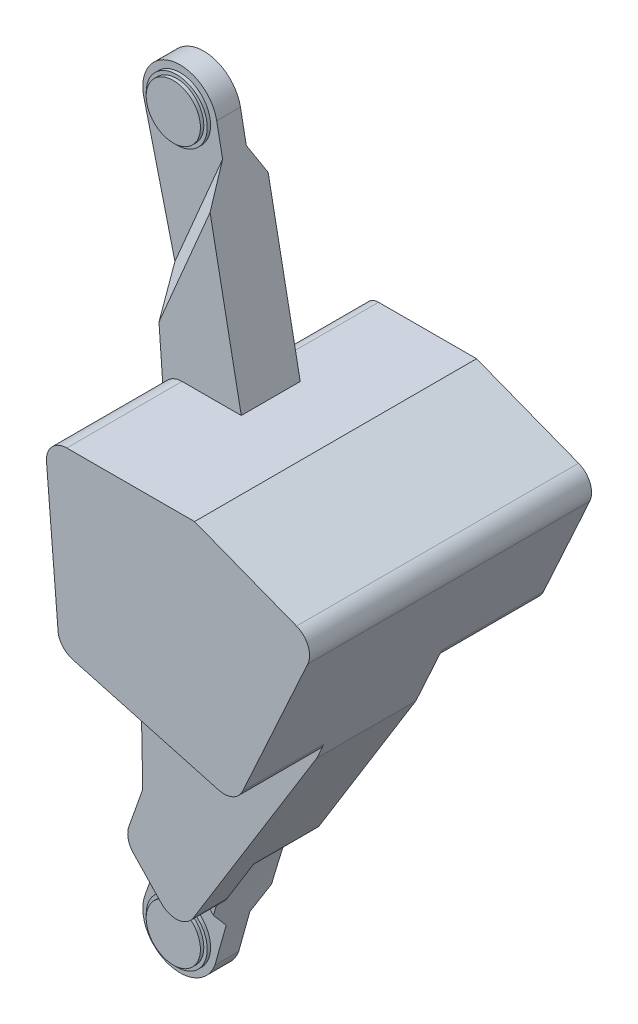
ISO-10303-21;
HEADER;
FILE_DESCRIPTION(('STEP AP214'),'2;1');
FILE_NAME('part.step','',(''),(''),'','','');
FILE_SCHEMA(('AUTOMOTIVE_DESIGN { 1 0 10303 214 1 1 1 1 }'));
ENDSEC;
DATA;
#1=APPLICATION_CONTEXT('core data for automotive mechanical design processes');
#2=APPLICATION_PROTOCOL_DEFINITION('international standard','automotive_design',2000,#1);
#3=PRODUCT_CONTEXT('',#1,'mechanical');
#4=PRODUCT('Part','Part','',(#3));
#5=PRODUCT_RELATED_PRODUCT_CATEGORY('part','',(#4));
#6=PRODUCT_DEFINITION_FORMATION('','',#4);
#7=PRODUCT_DEFINITION_CONTEXT('part definition',#1,'design');
#8=PRODUCT_DEFINITION('design','',#6,#7);
#9=PRODUCT_DEFINITION_SHAPE('','',#8);
#10=(LENGTH_UNIT() NAMED_UNIT(*) SI_UNIT(.MILLI.,.METRE.));
#11=(NAMED_UNIT(*) PLANE_ANGLE_UNIT() SI_UNIT($,.RADIAN.));
#12=(NAMED_UNIT(*) SI_UNIT($,.STERADIAN.) SOLID_ANGLE_UNIT());
#13=UNCERTAINTY_MEASURE_WITH_UNIT(LENGTH_MEASURE(1.E-05),#10,'distance_accuracy_value','');
#14=(GEOMETRIC_REPRESENTATION_CONTEXT(3) GLOBAL_UNCERTAINTY_ASSIGNED_CONTEXT((#13)) GLOBAL_UNIT_ASSIGNED_CONTEXT((#10,
#11,#12)) REPRESENTATION_CONTEXT('',''));
#15=CARTESIAN_POINT('',(0.,0.,0.));
#16=DIRECTION('',(0.,0.,1.));
#17=DIRECTION('',(1.,0.,0.));
#18=AXIS2_PLACEMENT_3D('',#15,#16,#17);
#19=CARTESIAN_POINT('',(3964.69019911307,-1014.00064638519,34.9945264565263));
#20=DIRECTION('',(0.,0.,-1.));
#21=DIRECTION('',(-1.,0.,0.));
#22=AXIS2_PLACEMENT_3D('',#19,#20,#21);
#23=CYLINDRICAL_SURFACE('',#22,4000.);
#24=DIRECTION('',(0.,0.,1.));
#25=VECTOR('',#24,1.);
#26=CARTESIAN_POINT('',(157.495576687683,212.893443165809,-299.963916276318));
#27=LINE('',#26,#25);
#28=CARTESIAN_POINT('',(157.495576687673,212.893443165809,-24.0054735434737));
#29=VERTEX_POINT('',#28);
#30=CARTESIAN_POINT('',(157.495576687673,212.893443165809,62.9945264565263));
#31=VERTEX_POINT('',#30);
#32=EDGE_CURVE('E382',#29,#31,#27,.T.);
#33=ORIENTED_EDGE('',*,*,#32,.T.);
#34=CARTESIAN_POINT('',(3964.69019911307,-1014.00064638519,62.9945264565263));
#35=DIRECTION('',(0.,0.,1.));
#36=DIRECTION('',(0.,-1.,0.));
#37=AXIS2_PLACEMENT_3D('',#34,#35,#36);
#38=CIRCLE('',#37,4000.);
#39=CARTESIAN_POINT('',(135.243751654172,141.568436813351,62.9945264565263));
#40=VERTEX_POINT('',#39);
#41=EDGE_CURVE('E579',#40,#31,#38,.F.);
#42=ORIENTED_EDGE('',*,*,#41,.F.);
#43=CARTESIAN_POINT('',(3964.69019911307,-1014.00064638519,62.9945264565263));
#44=DIRECTION('',(0.,0.,-1.));
#45=DIRECTION('',(1.,0.,0.));
#46=AXIS2_PLACEMENT_3D('',#43,#44,#45);
#47=CIRCLE('',#46,4000.);
#48=CARTESIAN_POINT('',(129.292486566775,121.65968425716,62.9945264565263));
#49=VERTEX_POINT('',#48);
#50=EDGE_CURVE('E671',#49,#40,#47,.T.);
#51=ORIENTED_EDGE('',*,*,#50,.F.);
#52=CARTESIAN_POINT('',(3964.69019911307,-1014.00064638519,2060.50000915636));
#53=DIRECTION('',(0.512515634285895,0.487162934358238,-0.707106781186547));
#54=DIRECTION('',(-0.512515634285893,-0.487162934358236,-0.707106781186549));
#55=AXIS2_PLACEMENT_3D('',#52,#53,#54);
#56=ELLIPSE('',#55,5656.85424949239,4000.);
#57=CARTESIAN_POINT('',(120.221173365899,90.5616696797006,34.9945264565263));
#58=VERTEX_POINT('',#57);
#59=EDGE_CURVE('E795',#49,#58,#56,.F.);
#60=ORIENTED_EDGE('',*,*,#59,.T.);
#61=CARTESIAN_POINT('',(3964.69019911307,-1014.00064638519,34.9945264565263));
#62=DIRECTION('',(0.,0.,-1.));
#63=DIRECTION('',(-1.,0.,0.));
#64=AXIS2_PLACEMENT_3D('',#61,#62,#63);
#65=CIRCLE('',#64,4000.);
#66=CARTESIAN_POINT('',(103.686960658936,31.3002637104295,34.9945264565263));
#67=VERTEX_POINT('',#66);
#68=EDGE_CURVE('E743',#67,#58,#65,.T.);
#69=ORIENTED_EDGE('',*,*,#68,.F.);
#70=DIRECTION('',(0.,0.,-1.));
#71=VECTOR('',#70,1.);
#72=CARTESIAN_POINT('',(103.686960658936,31.3002637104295,34.9945264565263));
#73=LINE('',#72,#71);
#74=CARTESIAN_POINT('',(103.686960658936,31.3002637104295,-0.00547354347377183));
#75=VERTEX_POINT('',#74);
#76=EDGE_CURVE('E751',#67,#75,#73,.T.);
#77=ORIENTED_EDGE('',*,*,#76,.T.);
#78=CARTESIAN_POINT('',(3964.69019911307,-1014.00064638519,-0.00547354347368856));
#79=DIRECTION('',(0.,0.,-1.));
#80=DIRECTION('',(-1.,0.,0.));
#81=AXIS2_PLACEMENT_3D('',#78,#79,#80);
#82=CIRCLE('',#81,4000.);
#83=CARTESIAN_POINT('',(120.221173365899,90.5616696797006,-0.00547354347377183));
#84=VERTEX_POINT('',#83);
#85=EDGE_CURVE('E728',#75,#84,#82,.T.);
#86=ORIENTED_EDGE('',*,*,#85,.T.);
#87=CARTESIAN_POINT('',(3964.69019911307,-1014.00064638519,-2025.5109562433));
#88=DIRECTION('',(-0.512515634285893,-0.487162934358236,-0.707106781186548));
#89=DIRECTION('',(0.512515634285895,0.487162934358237,-0.707106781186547));
#90=AXIS2_PLACEMENT_3D('',#87,#88,#89);
#91=ELLIPSE('',#90,5656.85424949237,4000.);
#92=CARTESIAN_POINT('',(127.983803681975,117.230556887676,-24.0054735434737));
#93=VERTEX_POINT('',#92);
#94=EDGE_CURVE('E706',#84,#93,#91,.T.);
#95=ORIENTED_EDGE('',*,*,#94,.T.);
#96=CARTESIAN_POINT('',(3964.69019911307,-1014.00064638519,-24.0054735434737));
#97=DIRECTION('',(0.,0.,-1.));
#98=DIRECTION('',(1.,0.,0.));
#99=AXIS2_PLACEMENT_3D('',#96,#97,#98);
#100=CIRCLE('',#99,4000.);
#101=EDGE_CURVE('E33',#93,#29,#100,.T.);
#102=ORIENTED_EDGE('',*,*,#101,.T.);
#103=EDGE_LOOP('',(#33,#42,#51,#60,#69,#77,#86,#95,#102));
#104=FACE_BOUND('',#103,.T.);
#105=ADVANCED_FACE('F17',(#104),#23,.F.);
#106=CARTESIAN_POINT('',(145.581318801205,499.883655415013,500000.));
#107=DIRECTION('',(0.264252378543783,0.964453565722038,0.));
#108=DIRECTION('',(-0.964453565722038,0.264252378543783,0.));
#109=AXIS2_PLACEMENT_3D('',#106,#107,#108);
#110=PLANE('',#109);
#111=DIRECTION('',(0.,0.,-1.));
#112=VECTOR('',#111,1.);
#113=CARTESIAN_POINT('',(231.667125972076,476.296849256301,500000.));
#114=LINE('',#113,#112);
#115=CARTESIAN_POINT('',(231.667125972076,476.296849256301,-24.0054735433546));
#116=VERTEX_POINT('',#115);
#117=CARTESIAN_POINT('',(231.667125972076,476.296849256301,-33.0054735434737));
#118=VERTEX_POINT('',#117);
#119=EDGE_CURVE('E587',#116,#118,#114,.T.);
#120=ORIENTED_EDGE('',*,*,#119,.F.);
#121=DIRECTION('',(-0.964453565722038,0.264252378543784,0.));
#122=VECTOR('',#121,1.);
#123=CARTESIAN_POINT('',(231.667125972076,476.296849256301,-24.0054735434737));
#124=LINE('',#123,#122);
#125=CARTESIAN_POINT('',(145.581318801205,499.883655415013,-24.0054735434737));
#126=VERTEX_POINT('',#125);
#127=EDGE_CURVE('E370',#116,#126,#124,.T.);
#128=ORIENTED_EDGE('',*,*,#127,.T.);
#129=DIRECTION('',(0.,0.,1.));
#130=VECTOR('',#129,1.);
#131=CARTESIAN_POINT('',(145.581318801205,499.883655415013,-183.005473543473));
#132=LINE('',#131,#130);
#133=CARTESIAN_POINT('',(145.581318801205,499.883655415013,-183.005473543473));
#134=VERTEX_POINT('',#133);
#135=EDGE_CURVE('E565',#126,#134,#132,.F.);
#136=ORIENTED_EDGE('',*,*,#135,.T.);
#137=DIRECTION('',(-0.964453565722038,0.264252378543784,0.));
#138=VECTOR('',#137,1.);
#139=CARTESIAN_POINT('',(231.667125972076,476.296849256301,-183.005473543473));
#140=LINE('',#139,#138);
#141=CARTESIAN_POINT('',(231.667125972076,476.296849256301,-183.005473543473));
#142=VERTEX_POINT('',#141);
#143=EDGE_CURVE('E420',#142,#134,#140,.T.);
#144=ORIENTED_EDGE('',*,*,#143,.F.);
#145=DIRECTION('',(0.,0.,1.));
#146=VECTOR('',#145,1.);
#147=CARTESIAN_POINT('',(231.667125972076,476.296849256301,-183.005473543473));
#148=LINE('',#147,#146);
#149=EDGE_CURVE('E436',#142,#118,#148,.T.);
#150=ORIENTED_EDGE('',*,*,#149,.T.);
#151=EDGE_LOOP('',(#120,#128,#136,#144,#150));
#152=FACE_BOUND('',#151,.T.);
#153=ADVANCED_FACE('F825',(#152),#110,.F.);
#154=CARTESIAN_POINT('',(3966.19460881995,-1009.29005606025,-318.764821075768));
#155=DIRECTION('',(0.,0.,1.));
#156=DIRECTION('',(0.999999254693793,0.00122090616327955,0.));
#157=AXIS2_PLACEMENT_3D('',#154,#155,#156);
#158=CYLINDRICAL_SURFACE('',#157,3991.);
#159=CARTESIAN_POINT('',(3966.19460881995,-1009.29005606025,-24.0054735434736));
#160=DIRECTION('',(0.,0.,1.));
#161=DIRECTION('',(1.,0.,0.));
#162=AXIS2_PLACEMENT_3D('',#159,#160,#161);
#163=CIRCLE('',#162,3991.);
#164=CARTESIAN_POINT('',(171.175816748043,225.988603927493,-24.0054735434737));
#165=VERTEX_POINT('',#164);
#166=CARTESIAN_POINT('',(207.857169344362,333.461108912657,-24.0054735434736));
#167=VERTEX_POINT('',#166);
#168=EDGE_CURVE('E363',#165,#167,#163,.F.);
#169=ORIENTED_EDGE('',*,*,#168,.T.);
#170=DIRECTION('',(0.,0.,1.));
#171=VECTOR('',#170,1.);
#172=CARTESIAN_POINT('',(207.857169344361,333.461108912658,-318.764821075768));
#173=LINE('',#172,#171);
#174=CARTESIAN_POINT('',(207.857169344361,333.461108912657,-33.0054735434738));
#175=VERTEX_POINT('',#174);
#176=EDGE_CURVE('E348',#175,#167,#173,.T.);
#177=ORIENTED_EDGE('',*,*,#176,.F.);
#178=CARTESIAN_POINT('',(3966.19460881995,-1009.29005606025,-33.0054735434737));
#179=DIRECTION('',(0.,0.,-1.));
#180=DIRECTION('',(-0.999999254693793,-0.00122090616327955,0.));
#181=AXIS2_PLACEMENT_3D('',#178,#179,#180);
#182=CIRCLE('',#181,3991.);
#183=CARTESIAN_POINT('',(171.175816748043,225.988603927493,-33.0054735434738));
#184=VERTEX_POINT('',#183);
#185=EDGE_CURVE('E393',#184,#175,#182,.T.);
#186=ORIENTED_EDGE('',*,*,#185,.F.);
#187=DIRECTION('',(0.,0.,1.));
#188=VECTOR('',#187,1.);
#189=CARTESIAN_POINT('',(171.175816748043,225.988603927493,-318.764821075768));
#190=LINE('',#189,#188);
#191=EDGE_CURVE('E359',#184,#165,#190,.T.);
#192=ORIENTED_EDGE('',*,*,#191,.T.);
#193=EDGE_LOOP('',(#169,#177,#186,#192));
#194=FACE_BOUND('',#193,.T.);
#195=ADVANCED_FACE('F364',(#194),#158,.T.);
#196=CARTESIAN_POINT('',(180.684758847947,222.89344316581,-318.764821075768));
#197=DIRECTION('',(0.,0.,1.));
#198=DIRECTION('',(0.999999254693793,0.00122090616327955,0.));
#199=AXIS2_PLACEMENT_3D('',#196,#197,#198);
#200=CYLINDRICAL_SURFACE('',#199,9.9999999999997);
#201=DIRECTION('',(0.,0.,1.));
#202=VECTOR('',#201,1.);
#203=CARTESIAN_POINT('',(180.684758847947,212.893443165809,-299.963916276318));
#204=LINE('',#203,#202);
#205=CARTESIAN_POINT('',(180.684758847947,212.893443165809,-24.0054735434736));
#206=VERTEX_POINT('',#205);
#207=CARTESIAN_POINT('',(180.684758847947,212.893443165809,62.9945264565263));
#208=VERTEX_POINT('',#207);
#209=EDGE_CURVE('E41',#206,#208,#204,.T.);
#210=ORIENTED_EDGE('',*,*,#209,.F.);
#211=CARTESIAN_POINT('',(180.684758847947,222.89344316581,-24.0054735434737));
#212=DIRECTION('',(0.,0.,1.));
#213=DIRECTION('',(1.,0.,0.));
#214=AXIS2_PLACEMENT_3D('',#211,#212,#213);
#215=CIRCLE('',#214,9.99999999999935);
#216=EDGE_CURVE('E374',#206,#165,#215,.F.);
#217=ORIENTED_EDGE('',*,*,#216,.T.);
#218=ORIENTED_EDGE('',*,*,#191,.F.);
#219=CARTESIAN_POINT('',(180.684758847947,222.89344316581,-33.0054735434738));
#220=DIRECTION('',(0.,0.,-1.));
#221=DIRECTION('',(-0.999999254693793,-0.00122090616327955,0.));
#222=AXIS2_PLACEMENT_3D('',#219,#220,#221);
#223=CIRCLE('',#222,9.9999999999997);
#224=CARTESIAN_POINT('',(189.194381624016,217.641175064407,-33.0054735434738));
#225=VERTEX_POINT('',#224);
#226=EDGE_CURVE('E396',#225,#184,#223,.T.);
#227=ORIENTED_EDGE('',*,*,#226,.F.);
#228=DIRECTION('',(0.,0.,1.));
#229=VECTOR('',#228,1.);
#230=CARTESIAN_POINT('',(189.194381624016,217.641175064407,-318.764821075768));
#231=LINE('',#230,#229);
#232=CARTESIAN_POINT('',(189.194381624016,217.641175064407,62.9945264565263));
#233=VERTEX_POINT('',#232);
#234=EDGE_CURVE('E390',#225,#233,#231,.T.);
#235=ORIENTED_EDGE('',*,*,#234,.T.);
#236=CARTESIAN_POINT('',(180.684758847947,222.89344316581,62.9945264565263));
#237=DIRECTION('',(0.,0.,-1.));
#238=DIRECTION('',(-0.999999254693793,-0.00122090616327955,0.));
#239=AXIS2_PLACEMENT_3D('',#236,#237,#238);
#240=CIRCLE('',#239,9.9999999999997);
#241=EDGE_CURVE('E391',#233,#208,#240,.T.);
#242=ORIENTED_EDGE('',*,*,#241,.T.);
#243=EDGE_LOOP('',(#210,#217,#218,#227,#235,#242));
#244=FACE_BOUND('',#243,.T.);
#245=ADVANCED_FACE('F937',(#244),#200,.T.);
#246=CARTESIAN_POINT('',(451.571489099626,710.98251710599,62.9945264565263));
#247=DIRECTION('',(0.,0.,1.));
#248=DIRECTION('',(0.999999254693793,0.00122090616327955,0.));
#249=AXIS2_PLACEMENT_3D('',#246,#247,#248);
#250=PLANE('',#249);
#251=DIRECTION('',(-1.,0.,0.));
#252=VECTOR('',#251,1.);
#253=CARTESIAN_POINT('',(180.684758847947,212.893443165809,62.9945264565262));
#254=LINE('',#253,#252);
#255=EDGE_CURVE('E379',#208,#31,#254,.T.);
#256=ORIENTED_EDGE('',*,*,#255,.F.);
#257=ORIENTED_EDGE('',*,*,#241,.F.);
#258=DIRECTION('',(-0.525226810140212,-0.850962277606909,0.));
#259=VECTOR('',#258,1.);
#260=CARTESIAN_POINT('',(129.292064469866,120.588604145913,62.9945264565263));
#261=LINE('',#260,#259);
#262=CARTESIAN_POINT('',(149.732955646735,153.706539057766,62.9945264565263));
#263=VERTEX_POINT('',#262);
#264=EDGE_CURVE('E404',#233,#263,#261,.T.);
#265=ORIENTED_EDGE('',*,*,#264,.T.);
#266=CARTESIAN_POINT('',(124.204087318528,169.463343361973,62.9945264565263));
#267=DIRECTION('',(0.,0.,1.));
#268=DIRECTION('',(0.999999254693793,0.00122090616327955,0.));
#269=AXIS2_PLACEMENT_3D('',#266,#267,#268);
#270=CIRCLE('',#269,30.);
#271=EDGE_CURVE('E531',#263,#40,#270,.F.);
#272=ORIENTED_EDGE('',*,*,#271,.T.);
#273=ORIENTED_EDGE('',*,*,#41,.T.);
#274=EDGE_LOOP('',(#256,#257,#265,#272,#273));
#275=FACE_BOUND('',#274,.T.);
#276=ADVANCED_FACE('F945',(#275),#250,.F.);
#277=CARTESIAN_POINT('',(-177.299436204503,471.067028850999,-33.0054735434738));
#278=DIRECTION('',(0.,0.,1.));
#279=DIRECTION('',(0.999999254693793,0.00122090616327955,0.));
#280=AXIS2_PLACEMENT_3D('',#277,#278,#279);
#281=CYLINDRICAL_SURFACE('',#280,409.);
#282=CARTESIAN_POINT('',(-177.299436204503,471.067028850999,-24.0054735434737));
#283=DIRECTION('',(0.,0.,1.));
#284=DIRECTION('',(1.,0.,0.));
#285=AXIS2_PLACEMENT_3D('',#282,#283,#284);
#286=CIRCLE('',#285,409.);
#287=EDGE_CURVE('E352',#167,#116,#286,.T.);
#288=ORIENTED_EDGE('',*,*,#287,.T.);
#289=ORIENTED_EDGE('',*,*,#119,.T.);
#290=CARTESIAN_POINT('',(-177.299436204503,471.067028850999,-33.0054735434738));
#291=DIRECTION('',(0.,0.,1.));
#292=DIRECTION('',(-0.999999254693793,-0.00122090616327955,0.));
#293=AXIS2_PLACEMENT_3D('',#290,#291,#292);
#294=CIRCLE('',#293,409.);
#295=EDGE_CURVE('E355',#175,#118,#294,.T.);
#296=ORIENTED_EDGE('',*,*,#295,.F.);
#297=ORIENTED_EDGE('',*,*,#176,.T.);
#298=EDGE_LOOP('',(#288,#289,#296,#297));
#299=FACE_BOUND('',#298,.T.);
#300=ADVANCED_FACE('F350',(#299),#281,.F.);
#301=CARTESIAN_POINT('',(-176.993380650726,471.414152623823,-24.0054735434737));
#302=DIRECTION('',(0.,0.,1.));
#303=DIRECTION('',(1.,0.,0.));
#304=AXIS2_PLACEMENT_3D('',#301,#302,#303);
#305=PLANE('',#304);
#306=ORIENTED_EDGE('',*,*,#127,.F.);
#307=ORIENTED_EDGE('',*,*,#287,.F.);
#308=ORIENTED_EDGE('',*,*,#168,.F.);
#309=ORIENTED_EDGE('',*,*,#216,.F.);
#310=DIRECTION('',(1.,0.,0.));
#311=VECTOR('',#310,1.);
#312=CARTESIAN_POINT('',(180.684758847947,212.893443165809,-24.0054735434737));
#313=LINE('',#312,#311);
#314=EDGE_CURVE('E371',#29,#206,#313,.T.);
#315=ORIENTED_EDGE('',*,*,#314,.F.);
#316=ORIENTED_EDGE('',*,*,#101,.F.);
#317=DIRECTION('',(-0.688952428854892,0.724806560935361,0.));
#318=VECTOR('',#317,1.);
#319=CARTESIAN_POINT('',(55.8465931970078,193.121897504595,-24.0054735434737));
#320=LINE('',#319,#318);
#321=CARTESIAN_POINT('',(47.4388276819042,201.967215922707,-24.0054735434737));
#322=VERTEX_POINT('',#321);
#323=EDGE_CURVE('E775',#93,#322,#320,.T.);
#324=ORIENTED_EDGE('',*,*,#323,.T.);
#325=DIRECTION('',(-0.333806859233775,-0.942641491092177,0.));
#326=VECTOR('',#325,1.);
#327=CARTESIAN_POINT('',(75.1699902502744,280.277603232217,-24.0054735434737));
#328=LINE('',#327,#326);
#329=CARTESIAN_POINT('',(75.1699902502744,280.277603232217,-24.0054735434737));
#330=VERTEX_POINT('',#329);
#331=EDGE_CURVE('E681',#330,#322,#328,.T.);
#332=ORIENTED_EDGE('',*,*,#331,.F.);
#333=DIRECTION('',(0.0174524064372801,-0.999847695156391,0.));
#334=VECTOR('',#333,1.);
#335=CARTESIAN_POINT('',(70.5192164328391,546.720256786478,-24.0054735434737));
#336=LINE('',#335,#334);
#337=CARTESIAN_POINT('',(70.5192164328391,546.720256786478,-24.0054735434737));
#338=VERTEX_POINT('',#337);
#339=EDGE_CURVE('E678',#338,#330,#336,.T.);
#340=ORIENTED_EDGE('',*,*,#339,.F.);
#341=DIRECTION('',(0.0732381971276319,-0.997314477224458,0.));
#342=VECTOR('',#341,1.);
#343=CARTESIAN_POINT('',(44.5347273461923,900.5616696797,-24.0054735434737));
#344=LINE('',#343,#342);
#345=CARTESIAN_POINT('',(48.3801106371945,848.197513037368,-24.0054735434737));
#346=VERTEX_POINT('',#345);
#347=EDGE_CURVE('E676',#346,#338,#344,.T.);
#348=ORIENTED_EDGE('',*,*,#347,.F.);
#349=DIRECTION('',(0.390731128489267,0.920504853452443,0.));
#350=VECTOR('',#349,1.);
#351=CARTESIAN_POINT('',(136.959885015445,1056.87838407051,-24.0054735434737));
#352=LINE('',#351,#350);
#353=CARTESIAN_POINT('',(123.057099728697,1024.12547446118,-24.0054735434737));
#354=VERTEX_POINT('',#353);
#355=EDGE_CURVE('E772',#346,#354,#352,.T.);
#356=ORIENTED_EDGE('',*,*,#355,.T.);
#357=DIRECTION('',(-0.190808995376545,0.981627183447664,0.));
#358=VECTOR('',#357,1.);
#359=CARTESIAN_POINT('',(215.657492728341,547.737750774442,-24.0054735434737));
#360=LINE('',#359,#358);
#361=CARTESIAN_POINT('',(170.386023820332,780.639267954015,-24.0054735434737));
#362=VERTEX_POINT('',#361);
#363=EDGE_CURVE('E674',#362,#354,#360,.T.);
#364=ORIENTED_EDGE('',*,*,#363,.F.);
#365=DIRECTION('',(0.999999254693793,0.00122090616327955,0.));
#366=VECTOR('',#365,1.);
#367=CARTESIAN_POINT('',(101.486286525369,780.555147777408,-24.0054735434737));
#368=LINE('',#367,#366);
#369=CARTESIAN_POINT('',(126.85420382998,780.586119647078,-24.0054735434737));
#370=VERTEX_POINT('',#369);
#371=EDGE_CURVE('E413',#370,#362,#368,.T.);
#372=ORIENTED_EDGE('',*,*,#371,.F.);
#373=CARTESIAN_POINT('',(126.878621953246,760.586134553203,-24.0054735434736));
#374=DIRECTION('',(0.,0.,1.));
#375=DIRECTION('',(0.999999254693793,0.00122090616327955,0.));
#376=AXIS2_PLACEMENT_3D('',#373,#374,#375);
#377=CIRCLE('',#376,20.);
#378=CARTESIAN_POINT('',(107.436588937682,755.89493510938,-24.0054735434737));
#379=VERTEX_POINT('',#378);
#380=EDGE_CURVE('E572',#370,#379,#377,.T.);
#381=ORIENTED_EDGE('',*,*,#380,.T.);
#382=DIRECTION('',(-0.234559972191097,0.972101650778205,0.));
#383=VECTOR('',#382,1.);
#384=CARTESIAN_POINT('',(101.486286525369,780.555147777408,-24.0054735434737));
#385=LINE('',#384,#383);
#386=CARTESIAN_POINT('',(131.638877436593,655.591868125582,-24.0054735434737));
#387=VERTEX_POINT('',#386);
#388=EDGE_CURVE('E411',#387,#379,#385,.T.);
#389=ORIENTED_EDGE('',*,*,#388,.F.);
#390=DIRECTION('',(0.134115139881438,0.990965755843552,0.));
#391=VECTOR('',#390,1.);
#392=CARTESIAN_POINT('',(131.638877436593,655.591868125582,-24.0054735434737));
#393=LINE('',#392,#391);
#394=CARTESIAN_POINT('',(116.512783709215,543.826403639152,-24.0054735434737));
#395=VERTEX_POINT('',#394);
#396=EDGE_CURVE('E409',#395,#387,#393,.T.);
#397=ORIENTED_EDGE('',*,*,#396,.F.);
#398=CARTESIAN_POINT('',(156.151413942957,538.461798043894,-24.0054735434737));
#399=DIRECTION('',(0.,0.,1.));
#400=DIRECTION('',(0.999999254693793,0.00122090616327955,0.));
#401=AXIS2_PLACEMENT_3D('',#398,#399,#400);
#402=CIRCLE('',#401,40.);
#403=EDGE_CURVE('E563',#395,#126,#402,.T.);
#404=ORIENTED_EDGE('',*,*,#403,.T.);
#405=EDGE_LOOP('',(#306,#307,#308,#309,#315,#316,#324,#332,#340,#348,#356,#364,#372,#381,#389,
#397,#404));
#406=FACE_BOUND('',#405,.T.);
#407=ADVANCED_FACE('F368',(#406),#305,.F.);
#408=CARTESIAN_POINT('',(-176.993380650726,471.414152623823,62.9945264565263));
#409=DIRECTION('',(0.,0.,1.));
#410=DIRECTION('',(1.,0.,0.));
#411=AXIS2_PLACEMENT_3D('',#408,#409,#410);
#412=PLANE('',#411);
#413=CARTESIAN_POINT('',(107.609848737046,144.470719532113,62.9945264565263));
#414=VERTEX_POINT('',#413);
#415=EDGE_CURVE('E535',#40,#414,#270,.F.);
#416=ORIENTED_EDGE('',*,*,#415,.T.);
#417=DIRECTION('',(0.688952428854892,-0.724806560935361,0.));
#418=VECTOR('',#417,1.);
#419=CARTESIAN_POINT('',(-190.740195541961,458.347353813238,62.9945264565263));
#420=LINE('',#419,#418);
#421=EDGE_CURVE('E783',#414,#49,#420,.T.);
#422=ORIENTED_EDGE('',*,*,#421,.T.);
#423=ORIENTED_EDGE('',*,*,#50,.T.);
#424=EDGE_LOOP('',(#416,#422,#423));
#425=FACE_BOUND('',#424,.T.);
#426=ADVANCED_FACE('F1023',(#425),#412,.T.);
#427=CARTESIAN_POINT('',(82.9507293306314,212.829152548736,62.9945264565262));
#428=DIRECTION('',(0.,0.,1.));
#429=DIRECTION('',(0.999999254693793,0.00122090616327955,0.));
#430=AXIS2_PLACEMENT_3D('',#427,#428,#429);
#431=CIRCLE('',#430,30.);
#432=CARTESIAN_POINT('',(57.095319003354,197.614102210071,62.9945264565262));
#433=VERTEX_POINT('',#432);
#434=CARTESIAN_POINT('',(53.8108171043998,219.961158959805,62.9945264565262));
#435=VERTEX_POINT('',#434);
#436=EDGE_CURVE('E530',#433,#435,#431,.F.);
#437=ORIENTED_EDGE('',*,*,#436,.T.);
#438=DIRECTION('',(-0.333806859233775,-0.942641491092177,0.));
#439=VECTOR('',#438,1.);
#440=CARTESIAN_POINT('',(75.1699902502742,280.277603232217,62.9945264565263));
#441=LINE('',#440,#439);
#442=CARTESIAN_POINT('',(48.9367596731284,206.197245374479,62.9945264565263));
#443=VERTEX_POINT('',#442);
#444=EDGE_CURVE('E668',#435,#443,#441,.T.);
#445=ORIENTED_EDGE('',*,*,#444,.T.);
#446=EDGE_CURVE('E784',#443,#433,#420,.T.);
#447=ORIENTED_EDGE('',*,*,#446,.T.);
#448=EDGE_LOOP('',(#437,#445,#447));
#449=FACE_BOUND('',#448,.T.);
#450=ADVANCED_FACE('F1008',(#449),#412,.T.);
#451=CARTESIAN_POINT('',(106.159485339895,1111.05616442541,34.9945264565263));
#452=DIRECTION('',(-0.981627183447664,-0.190808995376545,0.));
#453=DIRECTION('',(0.190808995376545,-0.981627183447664,0.));
#454=AXIS2_PLACEMENT_3D('',#451,#452,#453);
#455=PLANE('',#454);
#456=DIRECTION('',(0.,0.,1.));
#457=VECTOR('',#456,1.);
#458=CARTESIAN_POINT('',(170.386023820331,780.639267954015,34.9945264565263));
#459=LINE('',#458,#457);
#460=CARTESIAN_POINT('',(170.386023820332,780.639267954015,62.9945264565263));
#461=VERTEX_POINT('',#460);
#462=EDGE_CURVE('E589',#362,#461,#459,.T.);
#463=ORIENTED_EDGE('',*,*,#462,.F.);
#464=ORIENTED_EDGE('',*,*,#363,.T.);
#465=DIRECTION('',(-0.166539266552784,0.856770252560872,0.488067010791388));
#466=VECTOR('',#465,1.);
#467=CARTESIAN_POINT('',(114.867768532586,1066.25593115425,-0.00547354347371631));
#468=LINE('',#467,#466);
#469=CARTESIAN_POINT('',(114.867768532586,1066.25593115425,-0.00547354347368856));
#470=VERTEX_POINT('',#469);
#471=EDGE_CURVE('E781',#354,#470,#468,.T.);
#472=ORIENTED_EDGE('',*,*,#471,.T.);
#473=DIRECTION('',(-0.190808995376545,0.981627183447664,0.));
#474=VECTOR('',#473,1.);
#475=CARTESIAN_POINT('',(106.159485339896,1111.05616442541,-0.00547354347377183));
#476=LINE('',#475,#474);
#477=CARTESIAN_POINT('',(106.159485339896,1111.05616442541,-0.00547354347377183));
#478=VERTEX_POINT('',#477);
#479=EDGE_CURVE('E731',#470,#478,#476,.T.);
#480=ORIENTED_EDGE('',*,*,#479,.T.);
#481=DIRECTION('',(0.,0.,-1.));
#482=VECTOR('',#481,1.);
#483=CARTESIAN_POINT('',(106.159485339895,1111.05616442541,34.9945264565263));
#484=LINE('',#483,#482);
#485=CARTESIAN_POINT('',(106.159485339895,1111.05616442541,34.9945264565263));
#486=VERTEX_POINT('',#485);
#487=EDGE_CURVE('E748',#486,#478,#484,.T.);
#488=ORIENTED_EDGE('',*,*,#487,.F.);
#489=DIRECTION('',(-0.190808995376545,0.981627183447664,0.));
#490=VECTOR('',#489,1.);
#491=CARTESIAN_POINT('',(106.159485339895,1111.05616442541,34.9945264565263));
#492=LINE('',#491,#490);
#493=CARTESIAN_POINT('',(114.867768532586,1066.25593115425,34.9945264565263));
#494=VERTEX_POINT('',#493);
#495=EDGE_CURVE('E746',#494,#486,#492,.T.);
#496=ORIENTED_EDGE('',*,*,#495,.F.);
#497=DIRECTION('',(-0.166539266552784,0.85677025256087,-0.488067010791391));
#498=VECTOR('',#497,1.);
#499=CARTESIAN_POINT('',(199.145621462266,632.683964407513,281.982762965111));
#500=LINE('',#499,#498);
#501=CARTESIAN_POINT('',(124.421988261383,1017.103731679,62.9945264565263));
#502=VERTEX_POINT('',#501);
#503=EDGE_CURVE('E792',#494,#502,#500,.F.);
#504=ORIENTED_EDGE('',*,*,#503,.T.);
#505=DIRECTION('',(-0.190808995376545,0.981627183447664,0.));
#506=VECTOR('',#505,1.);
#507=CARTESIAN_POINT('',(215.657492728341,547.737750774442,62.9945264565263));
#508=LINE('',#507,#506);
#509=EDGE_CURVE('E661',#461,#502,#508,.T.);
#510=ORIENTED_EDGE('',*,*,#509,.F.);
#511=EDGE_LOOP('',(#463,#464,#472,#480,#488,#496,#504,#510));
#512=FACE_BOUND('',#511,.T.);
#513=ADVANCED_FACE('F835',(#512),#455,.F.);
#514=CARTESIAN_POINT('',(52.1699902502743,50.5616696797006,39.9945264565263));
#515=DIRECTION('',(0.,0.,1.));
#516=DIRECTION('',(1.,0.,0.));
#517=AXIS2_PLACEMENT_3D('',#514,#515,#516);
#518=PLANE('',#517);
#519=CARTESIAN_POINT('',(52.1699902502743,50.5616696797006,39.9945264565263));
#520=DIRECTION('',(0.,0.,1.));
#521=DIRECTION('',(1.,0.,0.));
#522=AXIS2_PLACEMENT_3D('',#519,#520,#521);
#523=CIRCLE('',#522,45.);
#524=CARTESIAN_POINT('',(97.1699902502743,50.5616696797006,39.9945264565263));
#525=VERTEX_POINT('',#524);
#526=EDGE_CURVE('E699',#525,#525,#523,.T.);
#527=ORIENTED_EDGE('',*,*,#526,.T.);
#528=EDGE_LOOP('',(#527));
#529=FACE_BOUND('',#528,.T.);
#530=CARTESIAN_POINT('',(52.1699902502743,50.5616696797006,39.9945264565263));
#531=DIRECTION('',(0.,0.,1.));
#532=DIRECTION('',(1.,0.,0.));
#533=AXIS2_PLACEMENT_3D('',#530,#531,#532);
#534=CIRCLE('',#533,40.);
#535=CARTESIAN_POINT('',(92.1699902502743,50.5616696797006,39.9945264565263));
#536=VERTEX_POINT('',#535);
#537=EDGE_CURVE('E598',#536,#536,#534,.T.);
#538=ORIENTED_EDGE('',*,*,#537,.F.);
#539=EDGE_LOOP('',(#538));
#540=FACE_BOUND('',#539,.T.);
#541=ADVANCED_FACE('F1056',(#529,#540),#518,.T.);
#542=CARTESIAN_POINT('',(52.1699902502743,50.5616696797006,-5.00547354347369));
#543=DIRECTION('',(0.,0.,1.));
#544=DIRECTION('',(1.,0.,0.));
#545=AXIS2_PLACEMENT_3D('',#542,#543,#544);
#546=PLANE('',#545);
#547=CARTESIAN_POINT('',(52.1699902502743,50.5616696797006,-5.00547354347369));
#548=DIRECTION('',(0.,0.,1.));
#549=DIRECTION('',(1.,0.,0.));
#550=AXIS2_PLACEMENT_3D('',#547,#548,#549);
#551=CIRCLE('',#550,45.);
#552=CARTESIAN_POINT('',(97.1699902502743,50.5616696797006,-5.00547354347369));
#553=VERTEX_POINT('',#552);
#554=EDGE_CURVE('E696',#553,#553,#551,.T.);
#555=ORIENTED_EDGE('',*,*,#554,.F.);
#556=EDGE_LOOP('',(#555));
#557=FACE_BOUND('',#556,.T.);
#558=CARTESIAN_POINT('',(52.1699902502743,50.5616696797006,-5.00547354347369));
#559=DIRECTION('',(0.,0.,1.));
#560=DIRECTION('',(1.,0.,0.));
#561=AXIS2_PLACEMENT_3D('',#558,#559,#560);
#562=CIRCLE('',#561,40.);
#563=CARTESIAN_POINT('',(92.1699902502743,50.5616696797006,-5.00547354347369));
#564=VERTEX_POINT('',#563);
#565=EDGE_CURVE('E11',#564,#564,#562,.F.);
#566=ORIENTED_EDGE('',*,*,#565,.F.);
#567=EDGE_LOOP('',(#566));
#568=FACE_BOUND('',#567,.T.);
#569=ADVANCED_FACE('F819',(#557,#568),#546,.F.);
#570=CARTESIAN_POINT('',(52.1699902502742,1100.5616696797,39.9945264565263));
#571=DIRECTION('',(0.,0.,1.));
#572=DIRECTION('',(1.,0.,0.));
#573=AXIS2_PLACEMENT_3D('',#570,#571,#572);
#574=PLANE('',#573);
#575=CARTESIAN_POINT('',(52.1699902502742,1100.5616696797,39.9945264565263));
#576=DIRECTION('',(0.,0.,1.));
#577=DIRECTION('',(1.,0.,0.));
#578=AXIS2_PLACEMENT_3D('',#575,#576,#577);
#579=CIRCLE('',#578,45.);
#580=CARTESIAN_POINT('',(97.1699902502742,1100.5616696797,39.9945264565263));
#581=VERTEX_POINT('',#580);
#582=EDGE_CURVE('E711',#581,#581,#579,.T.);
#583=ORIENTED_EDGE('',*,*,#582,.T.);
#584=EDGE_LOOP('',(#583));
#585=FACE_BOUND('',#584,.T.);
#586=CARTESIAN_POINT('',(52.1699902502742,1100.5616696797,39.9945264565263));
#587=DIRECTION('',(0.,0.,1.));
#588=DIRECTION('',(1.,0.,0.));
#589=AXIS2_PLACEMENT_3D('',#586,#587,#588);
#590=CIRCLE('',#589,40.);
#591=CARTESIAN_POINT('',(92.1699902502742,1100.5616696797,39.9945264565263));
#592=VERTEX_POINT('',#591);
#593=EDGE_CURVE('E607',#592,#592,#590,.T.);
#594=ORIENTED_EDGE('',*,*,#593,.F.);
#595=EDGE_LOOP('',(#594));
#596=FACE_BOUND('',#595,.T.);
#597=ADVANCED_FACE('F807',(#585,#596),#574,.T.);
#598=CARTESIAN_POINT('',(52.1699902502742,1100.5616696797,-5.00547354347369));
#599=DIRECTION('',(0.,0.,1.));
#600=DIRECTION('',(1.,0.,0.));
#601=AXIS2_PLACEMENT_3D('',#598,#599,#600);
#602=PLANE('',#601);
#603=CARTESIAN_POINT('',(52.1699902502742,1100.5616696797,-5.00547354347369));
#604=DIRECTION('',(0.,0.,1.));
#605=DIRECTION('',(1.,0.,0.));
#606=AXIS2_PLACEMENT_3D('',#603,#604,#605);
#607=CIRCLE('',#606,45.);
#608=CARTESIAN_POINT('',(97.1699902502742,1100.5616696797,-5.00547354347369));
#609=VERTEX_POINT('',#608);
#610=EDGE_CURVE('E708',#609,#609,#607,.T.);
#611=ORIENTED_EDGE('',*,*,#610,.F.);
#612=EDGE_LOOP('',(#611));
#613=FACE_BOUND('',#612,.T.);
#614=CARTESIAN_POINT('',(52.1699902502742,1100.5616696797,-5.00547354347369));
#615=DIRECTION('',(0.,0.,1.));
#616=DIRECTION('',(1.,0.,0.));
#617=AXIS2_PLACEMENT_3D('',#614,#615,#616);
#618=CIRCLE('',#617,40.);
#619=CARTESIAN_POINT('',(92.1699902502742,1100.5616696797,-5.00547354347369));
#620=VERTEX_POINT('',#619);
#621=EDGE_CURVE('E26',#620,#620,#618,.F.);
#622=ORIENTED_EDGE('',*,*,#621,.F.);
#623=EDGE_LOOP('',(#622));
#624=FACE_BOUND('',#623,.T.);
#625=ADVANCED_FACE('F804',(#613,#624),#602,.F.);
#626=CARTESIAN_POINT('',(70.5192164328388,546.720256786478,34.9945264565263));
#627=DIRECTION('',(0.999847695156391,0.0174524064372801,0.));
#628=DIRECTION('',(-0.0174524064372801,0.999847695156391,0.));
#629=AXIS2_PLACEMENT_3D('',#626,#627,#628);
#630=PLANE('',#629);
#631=DIRECTION('',(0.,0.,-1.));
#632=VECTOR('',#631,1.);
#633=CARTESIAN_POINT('',(70.5192164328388,546.720256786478,34.9945264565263));
#634=LINE('',#633,#632);
#635=CARTESIAN_POINT('',(70.5192164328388,546.720256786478,62.9945264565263));
#636=VERTEX_POINT('',#635);
#637=EDGE_CURVE('E759',#636,#338,#634,.T.);
#638=ORIENTED_EDGE('',*,*,#637,.T.);
#639=ORIENTED_EDGE('',*,*,#339,.T.);
#640=DIRECTION('',(0.,0.,-1.));
#641=VECTOR('',#640,1.);
#642=CARTESIAN_POINT('',(75.1699902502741,280.277603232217,34.9945264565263));
#643=LINE('',#642,#641);
#644=CARTESIAN_POINT('',(75.1699902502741,280.277603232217,62.9945264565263));
#645=VERTEX_POINT('',#644);
#646=EDGE_CURVE('E757',#645,#330,#643,.T.);
#647=ORIENTED_EDGE('',*,*,#646,.F.);
#648=DIRECTION('',(0.0174524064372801,-0.999847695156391,0.));
#649=VECTOR('',#648,1.);
#650=CARTESIAN_POINT('',(70.5192164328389,546.720256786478,62.9945264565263));
#651=LINE('',#650,#649);
#652=EDGE_CURVE('E666',#636,#645,#651,.T.);
#653=ORIENTED_EDGE('',*,*,#652,.F.);
#654=EDGE_LOOP('',(#638,#639,#647,#653));
#655=FACE_BOUND('',#654,.T.);
#656=DIRECTION('',(-0.0174524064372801,0.999847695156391,0.));
#657=VECTOR('',#656,1.);
#658=CARTESIAN_POINT('',(72.1076800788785,455.71723545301,58.4945264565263));
#659=LINE('',#658,#657);
#660=CARTESIAN_POINT('',(74.7255410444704,305.74008117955,58.4945264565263));
#661=VERTEX_POINT('',#660);
#662=CARTESIAN_POINT('',(72.1076800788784,455.71723545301,58.4945264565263));
#663=VERTEX_POINT('',#662);
#664=EDGE_CURVE('E616',#661,#663,#659,.T.);
#665=ORIENTED_EDGE('',*,*,#664,.F.);
#666=DIRECTION('',(0.,0.,1.));
#667=VECTOR('',#666,1.);
#668=CARTESIAN_POINT('',(74.7255410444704,305.74008117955,58.4945264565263));
#669=LINE('',#668,#667);
#670=CARTESIAN_POINT('',(74.7255410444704,305.74008117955,8.49452645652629));
#671=VERTEX_POINT('',#670);
#672=EDGE_CURVE('E625',#671,#661,#669,.T.);
#673=ORIENTED_EDGE('',*,*,#672,.F.);
#674=DIRECTION('',(0.0174524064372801,-0.999847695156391,0.));
#675=VECTOR('',#674,1.);
#676=CARTESIAN_POINT('',(72.1076800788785,455.71723545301,8.49452645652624));
#677=LINE('',#676,#675);
#678=CARTESIAN_POINT('',(72.1076800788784,455.71723545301,8.49452645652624));
#679=VERTEX_POINT('',#678);
#680=EDGE_CURVE('E622',#679,#671,#677,.T.);
#681=ORIENTED_EDGE('',*,*,#680,.F.);
#682=DIRECTION('',(0.,0.,-1.));
#683=VECTOR('',#682,1.);
#684=CARTESIAN_POINT('',(72.1076800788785,455.71723545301,58.4945264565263));
#685=LINE('',#684,#683);
#686=EDGE_CURVE('E619',#663,#679,#685,.T.);
#687=ORIENTED_EDGE('',*,*,#686,.F.);
#688=EDGE_LOOP('',(#665,#673,#681,#687));
#689=FACE_BOUND('',#688,.T.);
#690=ADVANCED_FACE('F806',(#655,#689),#630,.F.);
#691=CARTESIAN_POINT('',(52.1699902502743,1100.5616696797,34.9945264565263));
#692=DIRECTION('',(0.,0.,-1.));
#693=DIRECTION('',(-1.,0.,0.));
#694=AXIS2_PLACEMENT_3D('',#691,#692,#693);
#695=PLANE('',#694);
#696=CARTESIAN_POINT('',(52.1699902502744,50.5616696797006,34.9945264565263));
#697=DIRECTION('',(0.,0.,-1.));
#698=DIRECTION('',(-1.,0.,0.));
#699=AXIS2_PLACEMENT_3D('',#696,#697,#698);
#700=CIRCLE('',#699,45.);
#701=CARTESIAN_POINT('',(7.16999025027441,50.5616696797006,34.9945264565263));
#702=VERTEX_POINT('',#701);
#703=EDGE_CURVE('E703',#702,#702,#700,.F.);
#704=ORIENTED_EDGE('',*,*,#703,.F.);
#705=EDGE_LOOP('',(#704));
#706=FACE_BOUND('',#705,.T.);
#707=ORIENTED_EDGE('',*,*,#68,.T.);
#708=DIRECTION('',(-0.688952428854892,0.724806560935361,0.));
#709=VECTOR('',#708,1.);
#710=CARTESIAN_POINT('',(-416.430504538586,655.141516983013,34.9945264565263));
#711=LINE('',#710,#709);
#712=CARTESIAN_POINT('',(38.4512357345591,176.587039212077,34.9945264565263));
#713=VERTEX_POINT('',#712);
#714=EDGE_CURVE('E694',#58,#713,#711,.T.);
#715=ORIENTED_EDGE('',*,*,#714,.T.);
#716=DIRECTION('',(-0.333806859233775,-0.942641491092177,0.));
#717=VECTOR('',#716,1.);
#718=CARTESIAN_POINT('',(75.1699902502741,280.277603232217,34.9945264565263));
#719=LINE('',#718,#717);
#720=CARTESIAN_POINT('',(0.324708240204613,68.9210469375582,34.9945264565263));
#721=VERTEX_POINT('',#720);
#722=EDGE_CURVE('E739',#713,#721,#719,.T.);
#723=ORIENTED_EDGE('',*,*,#722,.T.);
#724=CARTESIAN_POINT('',(52.1699902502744,50.5616696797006,34.9945264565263));
#725=DIRECTION('',(0.,0.,1.));
#726=DIRECTION('',(1.,0.,0.));
#727=AXIS2_PLACEMENT_3D('',#724,#725,#726);
#728=CIRCLE('',#727,55.);
#729=EDGE_CURVE('E741',#721,#67,#728,.T.);
#730=ORIENTED_EDGE('',*,*,#729,.T.);
#731=EDGE_LOOP('',(#707,#715,#723,#730));
#732=FACE_BOUND('',#731,.T.);
#733=ADVANCED_FACE('F816',(#706,#732),#695,.F.);
#734=CARTESIAN_POINT('',(52.1699902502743,1100.5616696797,-0.00547354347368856));
#735=DIRECTION('',(0.,0.,-1.));
#736=DIRECTION('',(-1.,0.,0.));
#737=AXIS2_PLACEMENT_3D('',#734,#735,#736);
#738=PLANE('',#737);
#739=DIRECTION('',(-0.688952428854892,0.724806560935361,0.));
#740=VECTOR('',#739,1.);
#741=CARTESIAN_POINT('',(-416.430504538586,655.141516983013,-0.00547354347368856));
#742=LINE('',#741,#740);
#743=CARTESIAN_POINT('',(38.4512357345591,176.587039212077,-0.00547354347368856));
#744=VERTEX_POINT('',#743);
#745=EDGE_CURVE('E691',#84,#744,#742,.T.);
#746=ORIENTED_EDGE('',*,*,#745,.F.);
#747=ORIENTED_EDGE('',*,*,#85,.F.);
#748=CARTESIAN_POINT('',(52.1699902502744,50.5616696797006,-0.00547354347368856));
#749=DIRECTION('',(0.,0.,1.));
#750=DIRECTION('',(1.,0.,0.));
#751=AXIS2_PLACEMENT_3D('',#748,#749,#750);
#752=CIRCLE('',#751,55.);
#753=CARTESIAN_POINT('',(0.324708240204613,68.9210469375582,-0.00547354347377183));
#754=VERTEX_POINT('',#753);
#755=EDGE_CURVE('E726',#754,#75,#752,.T.);
#756=ORIENTED_EDGE('',*,*,#755,.F.);
#757=DIRECTION('',(-0.333806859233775,-0.942641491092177,0.));
#758=VECTOR('',#757,1.);
#759=CARTESIAN_POINT('',(75.1699902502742,280.277603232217,-0.00547354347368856));
#760=LINE('',#759,#758);
#761=EDGE_CURVE('E724',#744,#754,#760,.T.);
#762=ORIENTED_EDGE('',*,*,#761,.F.);
#763=EDGE_LOOP('',(#746,#747,#756,#762));
#764=FACE_BOUND('',#763,.T.);
#765=CARTESIAN_POINT('',(52.1699902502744,50.5616696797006,-0.00547354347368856));
#766=DIRECTION('',(0.,0.,-1.));
#767=DIRECTION('',(-1.,0.,0.));
#768=AXIS2_PLACEMENT_3D('',#765,#766,#767);
#769=CIRCLE('',#768,45.);
#770=CARTESIAN_POINT('',(7.16999025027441,50.5616696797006,-0.00547354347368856));
#771=VERTEX_POINT('',#770);
#772=EDGE_CURVE('E702',#771,#771,#769,.F.);
#773=ORIENTED_EDGE('',*,*,#772,.T.);
#774=EDGE_LOOP('',(#773));
#775=FACE_BOUND('',#774,.T.);
#776=ADVANCED_FACE('F1032',(#764,#775),#738,.T.);
#777=CARTESIAN_POINT('',(52.1699902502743,1100.5616696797,34.9945264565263));
#778=DIRECTION('',(0.,0.,-1.));
#779=DIRECTION('',(-1.,0.,0.));
#780=AXIS2_PLACEMENT_3D('',#777,#778,#779);
#781=CIRCLE('',#780,45.);
#782=CARTESIAN_POINT('',(7.1699902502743,1100.5616696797,34.9945264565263));
#783=VERTEX_POINT('',#782);
#784=EDGE_CURVE('E707',#783,#783,#781,.F.);
#785=ORIENTED_EDGE('',*,*,#784,.F.);
#786=EDGE_LOOP('',(#785));
#787=FACE_BOUND('',#786,.T.);
#788=DIRECTION('',(0.23791992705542,-0.971284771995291,0.));
#789=VECTOR('',#788,1.);
#790=CARTESIAN_POINT('',(-1.25067220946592,1087.47607369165,34.9945264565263));
#791=LINE('',#790,#789);
#792=CARTESIAN_POINT('',(-1.25067220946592,1087.47607369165,34.9945264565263));
#793=VERTEX_POINT('',#792);
#794=CARTESIAN_POINT('',(44.5347273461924,900.5616696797,34.9945264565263));
#795=VERTEX_POINT('',#794);
#796=EDGE_CURVE('E736',#793,#795,#791,.T.);
#797=ORIENTED_EDGE('',*,*,#796,.T.);
#798=DIRECTION('',(0.390731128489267,0.920504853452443,0.));
#799=VECTOR('',#798,1.);
#800=CARTESIAN_POINT('',(117.634389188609,1072.77368097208,34.9945264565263));
#801=LINE('',#800,#799);
#802=EDGE_CURVE('E688',#795,#494,#801,.T.);
#803=ORIENTED_EDGE('',*,*,#802,.T.);
#804=ORIENTED_EDGE('',*,*,#495,.T.);
#805=CARTESIAN_POINT('',(52.1699902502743,1100.5616696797,34.9945264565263));
#806=DIRECTION('',(0.,0.,1.));
#807=DIRECTION('',(-1.,0.,0.));
#808=AXIS2_PLACEMENT_3D('',#805,#806,#807);
#809=CIRCLE('',#808,55.);
#810=EDGE_CURVE('E733',#486,#793,#809,.T.);
#811=ORIENTED_EDGE('',*,*,#810,.T.);
#812=EDGE_LOOP('',(#797,#803,#804,#811));
#813=FACE_BOUND('',#812,.T.);
#814=ADVANCED_FACE('F870',(#787,#813),#695,.F.);
#815=DIRECTION('',(0.390731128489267,0.920504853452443,0.));
#816=VECTOR('',#815,1.);
#817=CARTESIAN_POINT('',(117.634389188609,1072.77368097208,-0.00547354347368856));
#818=LINE('',#817,#816);
#819=CARTESIAN_POINT('',(44.5347273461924,900.5616696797,-0.00547354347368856));
#820=VERTEX_POINT('',#819);
#821=EDGE_CURVE('E685',#820,#470,#818,.T.);
#822=ORIENTED_EDGE('',*,*,#821,.F.);
#823=DIRECTION('',(0.23791992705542,-0.971284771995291,0.));
#824=VECTOR('',#823,1.);
#825=CARTESIAN_POINT('',(-1.25067220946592,1087.47607369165,-0.00547354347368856));
#826=LINE('',#825,#824);
#827=CARTESIAN_POINT('',(-1.25067220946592,1087.47607369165,-0.00547354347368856));
#828=VERTEX_POINT('',#827);
#829=EDGE_CURVE('E721',#828,#820,#826,.T.);
#830=ORIENTED_EDGE('',*,*,#829,.F.);
#831=CARTESIAN_POINT('',(52.1699902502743,1100.5616696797,-0.00547354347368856));
#832=DIRECTION('',(0.,0.,1.));
#833=DIRECTION('',(-1.,0.,0.));
#834=AXIS2_PLACEMENT_3D('',#831,#832,#833);
#835=CIRCLE('',#834,55.);
#836=EDGE_CURVE('E718',#478,#828,#835,.T.);
#837=ORIENTED_EDGE('',*,*,#836,.F.);
#838=ORIENTED_EDGE('',*,*,#479,.F.);
#839=EDGE_LOOP('',(#822,#830,#837,#838));
#840=FACE_BOUND('',#839,.T.);
#841=CARTESIAN_POINT('',(52.1699902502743,1100.5616696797,-0.00547354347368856));
#842=DIRECTION('',(0.,0.,-1.));
#843=DIRECTION('',(-1.,0.,0.));
#844=AXIS2_PLACEMENT_3D('',#841,#842,#843);
#845=CIRCLE('',#844,45.);
#846=CARTESIAN_POINT('',(7.1699902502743,1100.5616696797,-0.00547354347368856));
#847=VERTEX_POINT('',#846);
#848=EDGE_CURVE('E714',#847,#847,#845,.F.);
#849=ORIENTED_EDGE('',*,*,#848,.T.);
#850=EDGE_LOOP('',(#849));
#851=FACE_BOUND('',#850,.T.);
#852=ADVANCED_FACE('F856',(#840,#851),#738,.T.);
#853=CARTESIAN_POINT('',(52.1699902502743,1100.5616696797,34.9945264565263));
#854=DIRECTION('',(0.,0.,-1.));
#855=DIRECTION('',(-1.,0.,0.));
#856=AXIS2_PLACEMENT_3D('',#853,#854,#855);
#857=CYLINDRICAL_SURFACE('',#856,55.);
#858=ORIENTED_EDGE('',*,*,#836,.T.);
#859=DIRECTION('',(0.,0.,-1.));
#860=VECTOR('',#859,1.);
#861=CARTESIAN_POINT('',(-1.25067220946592,1087.47607369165,34.9945264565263));
#862=LINE('',#861,#860);
#863=EDGE_CURVE('E717',#793,#828,#862,.T.);
#864=ORIENTED_EDGE('',*,*,#863,.F.);
#865=ORIENTED_EDGE('',*,*,#810,.F.);
#866=ORIENTED_EDGE('',*,*,#487,.T.);
#867=EDGE_LOOP('',(#858,#864,#865,#866));
#868=FACE_BOUND('',#867,.T.);
#869=ADVANCED_FACE('F19',(#868),#857,.T.);
#870=CARTESIAN_POINT('',(-1.25067220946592,1087.47607369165,34.9945264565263));
#871=DIRECTION('',(0.971284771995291,0.23791992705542,0.));
#872=DIRECTION('',(-0.23791992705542,0.971284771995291,0.));
#873=AXIS2_PLACEMENT_3D('',#870,#871,#872);
#874=PLANE('',#873);
#875=ORIENTED_EDGE('',*,*,#829,.T.);
#876=DIRECTION('',(0.,0.,-1.));
#877=VECTOR('',#876,1.);
#878=CARTESIAN_POINT('',(44.5347273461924,900.5616696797,34.9945264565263));
#879=LINE('',#878,#877);
#880=EDGE_CURVE('E762',#795,#820,#879,.T.);
#881=ORIENTED_EDGE('',*,*,#880,.F.);
#882=ORIENTED_EDGE('',*,*,#796,.F.);
#883=ORIENTED_EDGE('',*,*,#863,.T.);
#884=EDGE_LOOP('',(#875,#881,#882,#883));
#885=FACE_BOUND('',#884,.T.);
#886=ADVANCED_FACE('F848',(#885),#874,.F.);
#887=CARTESIAN_POINT('',(44.5347273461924,900.5616696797,34.9945264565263));
#888=DIRECTION('',(0.997314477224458,0.0732381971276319,0.));
#889=DIRECTION('',(-0.0732381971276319,0.997314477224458,0.));
#890=AXIS2_PLACEMENT_3D('',#887,#888,#889);
#891=PLANE('',#890);
#892=DIRECTION('',(0.0732381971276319,-0.997314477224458,0.));
#893=VECTOR('',#892,1.);
#894=CARTESIAN_POINT('',(44.5347273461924,900.5616696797,62.9945264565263));
#895=LINE('',#894,#893);
#896=CARTESIAN_POINT('',(49.0210078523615,839.470153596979,62.9945264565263));
#897=VERTEX_POINT('',#896);
#898=CARTESIAN_POINT('',(54.8082903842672,760.662360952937,62.9945264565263));
#899=VERTEX_POINT('',#898);
#900=EDGE_CURVE('E663',#897,#899,#895,.T.);
#901=ORIENTED_EDGE('',*,*,#900,.F.);
#902=DIRECTION('',(0.0666094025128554,-0.907047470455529,0.415725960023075));
#903=VECTOR('',#902,1.);
#904=CARTESIAN_POINT('',(72.0341782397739,526.090402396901,206.625485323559));
#905=LINE('',#904,#903);
#906=EDGE_CURVE('E790',#897,#795,#905,.F.);
#907=ORIENTED_EDGE('',*,*,#906,.T.);
#908=ORIENTED_EDGE('',*,*,#880,.T.);
#909=DIRECTION('',(0.0666094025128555,-0.90704747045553,-0.415725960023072));
#910=VECTOR('',#909,1.);
#911=CARTESIAN_POINT('',(34.8358841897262,1032.6347827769,60.527435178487));
#912=LINE('',#911,#910);
#913=EDGE_CURVE('E779',#820,#346,#912,.T.);
#914=ORIENTED_EDGE('',*,*,#913,.T.);
#915=ORIENTED_EDGE('',*,*,#347,.T.);
#916=ORIENTED_EDGE('',*,*,#637,.F.);
#917=DIRECTION('',(0.0732381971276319,-0.997314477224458,0.));
#918=VECTOR('',#917,1.);
#919=CARTESIAN_POINT('',(44.5347273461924,900.5616696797,62.9945264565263));
#920=LINE('',#919,#918);
#921=EDGE_CURVE('E585',#899,#636,#920,.T.);
#922=ORIENTED_EDGE('',*,*,#921,.F.);
#923=EDGE_LOOP('',(#901,#907,#908,#914,#915,#916,#922));
#924=FACE_BOUND('',#923,.T.);
#925=ADVANCED_FACE('F844',(#924),#891,.F.);
#926=CARTESIAN_POINT('',(75.1699902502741,280.277603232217,34.9945264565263));
#927=DIRECTION('',(0.942641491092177,-0.333806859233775,0.));
#928=DIRECTION('',(0.333806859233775,0.942641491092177,0.));
#929=AXIS2_PLACEMENT_3D('',#926,#927,#928);
#930=PLANE('',#929);
#931=ORIENTED_EDGE('',*,*,#722,.F.);
#932=DIRECTION('',(-0.249181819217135,-0.703667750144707,-0.665402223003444));
#933=VECTOR('',#932,1.);
#934=CARTESIAN_POINT('',(78.2671442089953,289.023696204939,141.316866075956));
#935=LINE('',#934,#933);
#936=EDGE_CURVE('E797',#713,#443,#935,.F.);
#937=ORIENTED_EDGE('',*,*,#936,.T.);
#938=ORIENTED_EDGE('',*,*,#444,.F.);
#939=EDGE_CURVE('E669',#645,#435,#441,.T.);
#940=ORIENTED_EDGE('',*,*,#939,.F.);
#941=ORIENTED_EDGE('',*,*,#646,.T.);
#942=ORIENTED_EDGE('',*,*,#331,.T.);
#943=DIRECTION('',(-0.249181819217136,-0.703667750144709,0.665402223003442));
#944=VECTOR('',#943,1.);
#945=CARTESIAN_POINT('',(28.4446678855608,148.329363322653,26.7155469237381));
#946=LINE('',#945,#944);
#947=EDGE_CURVE('E777',#322,#744,#946,.T.);
#948=ORIENTED_EDGE('',*,*,#947,.T.);
#949=ORIENTED_EDGE('',*,*,#761,.T.);
#950=DIRECTION('',(0.,0.,-1.));
#951=VECTOR('',#950,1.);
#952=CARTESIAN_POINT('',(0.324708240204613,68.9210469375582,34.9945264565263));
#953=LINE('',#952,#951);
#954=EDGE_CURVE('E754',#721,#754,#953,.T.);
#955=ORIENTED_EDGE('',*,*,#954,.F.);
#956=EDGE_LOOP('',(#931,#937,#938,#940,#941,#942,#948,#949,#955));
#957=FACE_BOUND('',#956,.T.);
#958=ADVANCED_FACE('F841',(#957),#930,.F.);
#959=CARTESIAN_POINT('',(52.1699902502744,50.5616696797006,34.9945264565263));
#960=DIRECTION('',(0.,0.,-1.));
#961=DIRECTION('',(-1.,0.,0.));
#962=AXIS2_PLACEMENT_3D('',#959,#960,#961);
#963=CYLINDRICAL_SURFACE('',#962,55.);
#964=ORIENTED_EDGE('',*,*,#755,.T.);
#965=ORIENTED_EDGE('',*,*,#76,.F.);
#966=ORIENTED_EDGE('',*,*,#729,.F.);
#967=ORIENTED_EDGE('',*,*,#954,.T.);
#968=EDGE_LOOP('',(#964,#965,#966,#967));
#969=FACE_BOUND('',#968,.T.);
#970=ADVANCED_FACE('F837',(#969),#963,.T.);
#971=CARTESIAN_POINT('',(52.1699902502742,1100.5616696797,39.9945264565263));
#972=DIRECTION('',(0.,0.,-1.));
#973=DIRECTION('',(-1.,0.,0.));
#974=AXIS2_PLACEMENT_3D('',#971,#972,#973);
#975=CYLINDRICAL_SURFACE('',#974,45.);
#976=ORIENTED_EDGE('',*,*,#848,.F.);
#977=EDGE_LOOP('',(#976));
#978=FACE_BOUND('',#977,.T.);
#979=ORIENTED_EDGE('',*,*,#610,.T.);
#980=EDGE_LOOP('',(#979));
#981=FACE_BOUND('',#980,.T.);
#982=ADVANCED_FACE('F840',(#978,#981),#975,.T.);
#983=ORIENTED_EDGE('',*,*,#582,.F.);
#984=EDGE_LOOP('',(#983));
#985=FACE_BOUND('',#984,.T.);
#986=ORIENTED_EDGE('',*,*,#784,.T.);
#987=EDGE_LOOP('',(#986));
#988=FACE_BOUND('',#987,.T.);
#989=ADVANCED_FACE('F1062',(#985,#988),#975,.T.);
#990=CARTESIAN_POINT('',(52.1699902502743,50.5616696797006,39.9945264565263));
#991=DIRECTION('',(0.,0.,-1.));
#992=DIRECTION('',(-1.,0.,0.));
#993=AXIS2_PLACEMENT_3D('',#990,#991,#992);
#994=CYLINDRICAL_SURFACE('',#993,45.);
#995=ORIENTED_EDGE('',*,*,#772,.F.);
#996=EDGE_LOOP('',(#995));
#997=FACE_BOUND('',#996,.T.);
#998=ORIENTED_EDGE('',*,*,#554,.T.);
#999=EDGE_LOOP('',(#998));
#1000=FACE_BOUND('',#999,.T.);
#1001=ADVANCED_FACE('F1060',(#997,#1000),#994,.T.);
#1002=ORIENTED_EDGE('',*,*,#526,.F.);
#1003=EDGE_LOOP('',(#1002));
#1004=FACE_BOUND('',#1003,.T.);
#1005=ORIENTED_EDGE('',*,*,#703,.T.);
#1006=EDGE_LOOP('',(#1005));
#1007=FACE_BOUND('',#1006,.T.);
#1008=ADVANCED_FACE('F1047',(#1004,#1007),#994,.T.);
#1009=DIRECTION('',(0.999999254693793,0.00122090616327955,0.));
#1010=VECTOR('',#1009,1.);
#1011=CARTESIAN_POINT('',(271.486159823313,780.762701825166,62.9945264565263));
#1012=LINE('',#1011,#1010);
#1013=CARTESIAN_POINT('',(83.0097259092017,780.532589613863,62.9945264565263));
#1014=VERTEX_POINT('',#1013);
#1015=EDGE_CURVE('E479',#1014,#461,#1012,.T.);
#1016=ORIENTED_EDGE('',*,*,#1015,.T.);
#1017=ORIENTED_EDGE('',*,*,#509,.T.);
#1018=DIRECTION('',(-0.390731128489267,-0.920504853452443,0.));
#1019=VECTOR('',#1018,1.);
#1020=CARTESIAN_POINT('',(-117.863458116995,446.314989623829,62.9945264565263));
#1021=LINE('',#1020,#1019);
#1022=EDGE_CURVE('E787',#502,#897,#1021,.T.);
#1023=ORIENTED_EDGE('',*,*,#1022,.T.);
#1024=ORIENTED_EDGE('',*,*,#900,.T.);
#1025=CARTESIAN_POINT('',(83.0463530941,750.532611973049,62.9945264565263));
#1026=DIRECTION('',(0.,0.,1.));
#1027=DIRECTION('',(0.999999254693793,0.00122090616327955,0.));
#1028=AXIS2_PLACEMENT_3D('',#1025,#1026,#1027);
#1029=CIRCLE('',#1028,30.);
#1030=EDGE_CURVE('E521',#899,#1014,#1029,.F.);
#1031=ORIENTED_EDGE('',*,*,#1030,.T.);
#1032=EDGE_LOOP('',(#1016,#1017,#1023,#1024,#1031));
#1033=FACE_BOUND('',#1032,.T.);
#1034=ADVANCED_FACE('F895',(#1033),#412,.T.);
#1035=CARTESIAN_POINT('',(120.221173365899,90.5616696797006,-0.00547354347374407));
#1036=DIRECTION('',(-0.512515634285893,-0.487162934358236,-0.707106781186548));
#1037=DIRECTION('',(-0.809684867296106,0.,0.586864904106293));
#1038=AXIS2_PLACEMENT_3D('',#1035,#1036,#1037);
#1039=PLANE('',#1038);
#1040=ORIENTED_EDGE('',*,*,#947,.F.);
#1041=ORIENTED_EDGE('',*,*,#323,.F.);
#1042=ORIENTED_EDGE('',*,*,#94,.F.);
#1043=ORIENTED_EDGE('',*,*,#745,.T.);
#1044=EDGE_LOOP('',(#1040,#1041,#1042,#1043));
#1045=FACE_BOUND('',#1044,.T.);
#1046=ADVANCED_FACE('F1037',(#1045),#1039,.T.);
#1047=CARTESIAN_POINT('',(114.867768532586,1066.25593115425,-0.00547354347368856));
#1048=DIRECTION('',(-0.650895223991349,0.276288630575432,-0.707106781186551));
#1049=DIRECTION('',(-0.735745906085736,0.,0.67725767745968));
#1050=AXIS2_PLACEMENT_3D('',#1047,#1048,#1049);
#1051=PLANE('',#1050);
#1052=ORIENTED_EDGE('',*,*,#471,.F.);
#1053=ORIENTED_EDGE('',*,*,#355,.F.);
#1054=ORIENTED_EDGE('',*,*,#913,.F.);
#1055=ORIENTED_EDGE('',*,*,#821,.T.);
#1056=EDGE_LOOP('',(#1052,#1053,#1054,#1055));
#1057=FACE_BOUND('',#1056,.T.);
#1058=ADVANCED_FACE('F879',(#1057),#1051,.T.);
#1059=CARTESIAN_POINT('',(-117.863458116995,446.314989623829,62.9945264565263));
#1060=DIRECTION('',(0.650895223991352,-0.276288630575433,-0.707106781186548));
#1061=DIRECTION('',(-0.735745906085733,0.,-0.677257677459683));
#1062=AXIS2_PLACEMENT_3D('',#1059,#1060,#1061);
#1063=PLANE('',#1062);
#1064=ORIENTED_EDGE('',*,*,#503,.F.);
#1065=ORIENTED_EDGE('',*,*,#802,.F.);
#1066=ORIENTED_EDGE('',*,*,#906,.F.);
#1067=ORIENTED_EDGE('',*,*,#1022,.F.);
#1068=EDGE_LOOP('',(#1064,#1065,#1066,#1067));
#1069=FACE_BOUND('',#1068,.T.);
#1070=ADVANCED_FACE('F897',(#1069),#1063,.F.);
#1071=CARTESIAN_POINT('',(-190.740195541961,458.347353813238,62.9945264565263));
#1072=DIRECTION('',(0.512515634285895,0.487162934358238,-0.707106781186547));
#1073=DIRECTION('',(-0.809684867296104,0.,-0.586864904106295));
#1074=AXIS2_PLACEMENT_3D('',#1071,#1072,#1073);
#1075=PLANE('',#1074);
#1076=ORIENTED_EDGE('',*,*,#936,.F.);
#1077=ORIENTED_EDGE('',*,*,#714,.F.);
#1078=ORIENTED_EDGE('',*,*,#59,.F.);
#1079=ORIENTED_EDGE('',*,*,#421,.F.);
#1080=DIRECTION('',(0.688952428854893,-0.72480656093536,0.));
#1081=VECTOR('',#1080,1.);
#1082=CARTESIAN_POINT('',(-190.740195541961,458.347353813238,62.9945264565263));
#1083=LINE('',#1082,#1081);
#1084=EDGE_CURVE('E582',#414,#433,#1083,.F.);
#1085=ORIENTED_EDGE('',*,*,#1084,.T.);
#1086=ORIENTED_EDGE('',*,*,#446,.F.);
#1087=EDGE_LOOP('',(#1076,#1077,#1078,#1079,#1085,#1086));
#1088=FACE_BOUND('',#1087,.T.);
#1089=ADVANCED_FACE('F1015',(#1088),#1075,.F.);
#1090=CARTESIAN_POINT('',(27.1145337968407,454.931877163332,58.4945264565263));
#1091=DIRECTION('',(0.,0.,-1.));
#1092=DIRECTION('',(0.,1.,0.));
#1093=AXIS2_PLACEMENT_3D('',#1090,#1091,#1092);
#1094=PLANE('',#1093);
#1095=ORIENTED_EDGE('',*,*,#664,.T.);
#1096=DIRECTION('',(0.999847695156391,0.0174524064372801,0.));
#1097=VECTOR('',#1096,1.);
#1098=CARTESIAN_POINT('',(27.1145337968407,454.931877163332,58.4945264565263));
#1099=LINE('',#1098,#1097);
#1100=CARTESIAN_POINT('',(27.1145337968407,454.931877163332,58.4945264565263));
#1101=VERTEX_POINT('',#1100);
#1102=EDGE_CURVE('E646',#1101,#663,#1099,.T.);
#1103=ORIENTED_EDGE('',*,*,#1102,.F.);
#1104=DIRECTION('',(-0.0174524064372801,0.999847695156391,0.));
#1105=VECTOR('',#1104,1.);
#1106=CARTESIAN_POINT('',(27.1145337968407,454.931877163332,58.4945264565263));
#1107=LINE('',#1106,#1105);
#1108=CARTESIAN_POINT('',(29.7323947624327,304.954722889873,58.4945264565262));
#1109=VERTEX_POINT('',#1108);
#1110=EDGE_CURVE('E628',#1109,#1101,#1107,.T.);
#1111=ORIENTED_EDGE('',*,*,#1110,.F.);
#1112=DIRECTION('',(0.999847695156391,0.0174524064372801,0.));
#1113=VECTOR('',#1112,1.);
#1114=CARTESIAN_POINT('',(29.7323947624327,304.954722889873,58.4945264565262));
#1115=LINE('',#1114,#1113);
#1116=EDGE_CURVE('E637',#1109,#661,#1115,.T.);
#1117=ORIENTED_EDGE('',*,*,#1116,.T.);
#1118=EDGE_LOOP('',(#1095,#1103,#1111,#1117));
#1119=FACE_BOUND('',#1118,.T.);
#1120=ADVANCED_FACE('F1131',(#1119),#1094,.F.);
#1121=CARTESIAN_POINT('',(27.1145337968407,454.931877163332,58.4945264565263));
#1122=DIRECTION('',(0.0174524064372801,-0.999847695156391,0.));
#1123=DIRECTION('',(0.999847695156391,0.0174524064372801,0.));
#1124=AXIS2_PLACEMENT_3D('',#1121,#1122,#1123);
#1125=PLANE('',#1124);
#1126=ORIENTED_EDGE('',*,*,#686,.T.);
#1127=DIRECTION('',(0.999847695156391,0.0174524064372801,0.));
#1128=VECTOR('',#1127,1.);
#1129=CARTESIAN_POINT('',(27.1145337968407,454.931877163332,8.49452645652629));
#1130=LINE('',#1129,#1128);
#1131=CARTESIAN_POINT('',(27.1145337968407,454.931877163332,8.49452645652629));
#1132=VERTEX_POINT('',#1131);
#1133=EDGE_CURVE('E643',#1132,#679,#1130,.T.);
#1134=ORIENTED_EDGE('',*,*,#1133,.F.);
#1135=DIRECTION('',(0.,0.,-1.));
#1136=VECTOR('',#1135,1.);
#1137=CARTESIAN_POINT('',(27.1145337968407,454.931877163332,58.4945264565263));
#1138=LINE('',#1137,#1136);
#1139=EDGE_CURVE('E631',#1101,#1132,#1138,.T.);
#1140=ORIENTED_EDGE('',*,*,#1139,.F.);
#1141=ORIENTED_EDGE('',*,*,#1102,.T.);
#1142=EDGE_LOOP('',(#1126,#1134,#1140,#1141));
#1143=FACE_BOUND('',#1142,.T.);
#1144=ADVANCED_FACE('F1127',(#1143),#1125,.F.);
#1145=CARTESIAN_POINT('',(27.1145337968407,454.931877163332,8.49452645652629));
#1146=DIRECTION('',(0.,0.,1.));
#1147=DIRECTION('',(0.,-1.,0.));
#1148=AXIS2_PLACEMENT_3D('',#1145,#1146,#1147);
#1149=PLANE('',#1148);
#1150=ORIENTED_EDGE('',*,*,#680,.T.);
#1151=DIRECTION('',(0.999847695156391,0.0174524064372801,0.));
#1152=VECTOR('',#1151,1.);
#1153=CARTESIAN_POINT('',(29.7323947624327,304.954722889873,8.49452645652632));
#1154=LINE('',#1153,#1152);
#1155=CARTESIAN_POINT('',(29.7323947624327,304.954722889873,8.49452645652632));
#1156=VERTEX_POINT('',#1155);
#1157=EDGE_CURVE('E640',#1156,#671,#1154,.T.);
#1158=ORIENTED_EDGE('',*,*,#1157,.F.);
#1159=DIRECTION('',(0.0174524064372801,-0.999847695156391,0.));
#1160=VECTOR('',#1159,1.);
#1161=CARTESIAN_POINT('',(27.1145337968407,454.931877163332,8.49452645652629));
#1162=LINE('',#1161,#1160);
#1163=EDGE_CURVE('E633',#1132,#1156,#1162,.T.);
#1164=ORIENTED_EDGE('',*,*,#1163,.F.);
#1165=ORIENTED_EDGE('',*,*,#1133,.T.);
#1166=EDGE_LOOP('',(#1150,#1158,#1164,#1165));
#1167=FACE_BOUND('',#1166,.T.);
#1168=ADVANCED_FACE('F1123',(#1167),#1149,.F.);
#1169=CARTESIAN_POINT('',(29.7323947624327,304.954722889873,58.4945264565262));
#1170=DIRECTION('',(-0.0174524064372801,0.999847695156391,0.));
#1171=DIRECTION('',(-0.999847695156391,-0.0174524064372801,0.));
#1172=AXIS2_PLACEMENT_3D('',#1169,#1170,#1171);
#1173=PLANE('',#1172);
#1174=ORIENTED_EDGE('',*,*,#672,.T.);
#1175=ORIENTED_EDGE('',*,*,#1116,.F.);
#1176=DIRECTION('',(0.,0.,1.));
#1177=VECTOR('',#1176,1.);
#1178=CARTESIAN_POINT('',(29.7323947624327,304.954722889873,58.4945264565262));
#1179=LINE('',#1178,#1177);
#1180=EDGE_CURVE('E635',#1156,#1109,#1179,.T.);
#1181=ORIENTED_EDGE('',*,*,#1180,.F.);
#1182=ORIENTED_EDGE('',*,*,#1157,.T.);
#1183=EDGE_LOOP('',(#1174,#1175,#1181,#1182));
#1184=FACE_BOUND('',#1183,.T.);
#1185=ADVANCED_FACE('F1119',(#1184),#1173,.F.);
#1186=CARTESIAN_POINT('',(29.7323947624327,304.954722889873,58.4945264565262));
#1187=DIRECTION('',(0.999847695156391,0.0174524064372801,0.));
#1188=DIRECTION('',(-0.0174524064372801,0.999847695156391,0.));
#1189=AXIS2_PLACEMENT_3D('',#1186,#1187,#1188);
#1190=PLANE('',#1189);
#1191=ORIENTED_EDGE('',*,*,#1110,.T.);
#1192=ORIENTED_EDGE('',*,*,#1139,.T.);
#1193=ORIENTED_EDGE('',*,*,#1163,.T.);
#1194=ORIENTED_EDGE('',*,*,#1180,.T.);
#1195=EDGE_LOOP('',(#1191,#1192,#1193,#1194));
#1196=FACE_BOUND('',#1195,.T.);
#1197=ADVANCED_FACE('F1107',(#1196),#1190,.F.);
#1198=CARTESIAN_POINT('',(52.1699902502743,1100.5616696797,-10.0054735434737));
#1199=DIRECTION('',(0.,0.,1.));
#1200=DIRECTION('',(1.,0.,0.));
#1201=AXIS2_PLACEMENT_3D('',#1198,#1199,#1200);
#1202=CYLINDRICAL_SURFACE('',#1201,40.);
#1203=CARTESIAN_POINT('',(52.1699902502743,1100.5616696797,-10.0054735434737));
#1204=DIRECTION('',(0.,0.,-1.));
#1205=DIRECTION('',(-1.,0.,0.));
#1206=AXIS2_PLACEMENT_3D('',#1203,#1204,#1205);
#1207=CIRCLE('',#1206,40.);
#1208=CARTESIAN_POINT('',(12.1699902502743,1100.5616696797,-10.0054735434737));
#1209=VERTEX_POINT('',#1208);
#1210=EDGE_CURVE('E613',#1209,#1209,#1207,.T.);
#1211=ORIENTED_EDGE('',*,*,#1210,.F.);
#1212=EDGE_LOOP('',(#1211));
#1213=FACE_BOUND('',#1212,.T.);
#1214=ORIENTED_EDGE('',*,*,#621,.T.);
#1215=EDGE_LOOP('',(#1214));
#1216=FACE_BOUND('',#1215,.T.);
#1217=ADVANCED_FACE('F802',(#1213,#1216),#1202,.T.);
#1218=CARTESIAN_POINT('',(52.1699902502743,1100.5616696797,-10.0054735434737));
#1219=DIRECTION('',(0.,0.,-1.));
#1220=DIRECTION('',(-1.,0.,0.));
#1221=AXIS2_PLACEMENT_3D('',#1218,#1219,#1220);
#1222=PLANE('',#1221);
#1223=ORIENTED_EDGE('',*,*,#1210,.T.);
#1224=EDGE_LOOP('',(#1223));
#1225=FACE_BOUND('',#1224,.T.);
#1226=ADVANCED_FACE('F1100',(#1225),#1222,.T.);
#1227=CARTESIAN_POINT('',(52.1699902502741,1100.5616696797,44.9945264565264));
#1228=DIRECTION('',(0.,0.,-1.));
#1229=DIRECTION('',(-1.,0.,0.));
#1230=AXIS2_PLACEMENT_3D('',#1227,#1228,#1229);
#1231=CYLINDRICAL_SURFACE('',#1230,40.);
#1232=CARTESIAN_POINT('',(52.1699902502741,1100.5616696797,44.9945264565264));
#1233=DIRECTION('',(0.,0.,1.));
#1234=DIRECTION('',(1.,0.,0.));
#1235=AXIS2_PLACEMENT_3D('',#1232,#1233,#1234);
#1236=CIRCLE('',#1235,40.);
#1237=CARTESIAN_POINT('',(92.1699902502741,1100.5616696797,44.9945264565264));
#1238=VERTEX_POINT('',#1237);
#1239=EDGE_CURVE('E610',#1238,#1238,#1236,.T.);
#1240=ORIENTED_EDGE('',*,*,#1239,.F.);
#1241=EDGE_LOOP('',(#1240));
#1242=FACE_BOUND('',#1241,.T.);
#1243=ORIENTED_EDGE('',*,*,#593,.T.);
#1244=EDGE_LOOP('',(#1243));
#1245=FACE_BOUND('',#1244,.T.);
#1246=ADVANCED_FACE('F1092',(#1242,#1245),#1231,.T.);
#1247=CARTESIAN_POINT('',(52.1699902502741,1100.5616696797,44.9945264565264));
#1248=DIRECTION('',(0.,0.,1.));
#1249=DIRECTION('',(1.,0.,0.));
#1250=AXIS2_PLACEMENT_3D('',#1247,#1248,#1249);
#1251=PLANE('',#1250);
#1252=ORIENTED_EDGE('',*,*,#1239,.T.);
#1253=EDGE_LOOP('',(#1252));
#1254=FACE_BOUND('',#1253,.T.);
#1255=ADVANCED_FACE('F1081',(#1254),#1251,.T.);
#1256=CARTESIAN_POINT('',(52.1699902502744,50.5616696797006,-10.0054735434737));
#1257=DIRECTION('',(0.,0.,1.));
#1258=DIRECTION('',(1.,0.,0.));
#1259=AXIS2_PLACEMENT_3D('',#1256,#1257,#1258);
#1260=CYLINDRICAL_SURFACE('',#1259,40.);
#1261=CARTESIAN_POINT('',(52.1699902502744,50.5616696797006,-10.0054735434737));
#1262=DIRECTION('',(0.,0.,-1.));
#1263=DIRECTION('',(-1.,0.,0.));
#1264=AXIS2_PLACEMENT_3D('',#1261,#1262,#1263);
#1265=CIRCLE('',#1264,40.);
#1266=CARTESIAN_POINT('',(12.1699902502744,50.5616696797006,-10.0054735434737));
#1267=VERTEX_POINT('',#1266);
#1268=EDGE_CURVE('E604',#1267,#1267,#1265,.T.);
#1269=ORIENTED_EDGE('',*,*,#1268,.F.);
#1270=EDGE_LOOP('',(#1269));
#1271=FACE_BOUND('',#1270,.T.);
#1272=ORIENTED_EDGE('',*,*,#565,.T.);
#1273=EDGE_LOOP('',(#1272));
#1274=FACE_BOUND('',#1273,.T.);
#1275=ADVANCED_FACE('F1078',(#1271,#1274),#1260,.T.);
#1276=CARTESIAN_POINT('',(52.1699902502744,50.5616696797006,-10.0054735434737));
#1277=DIRECTION('',(0.,0.,-1.));
#1278=DIRECTION('',(-1.,0.,0.));
#1279=AXIS2_PLACEMENT_3D('',#1276,#1277,#1278);
#1280=PLANE('',#1279);
#1281=ORIENTED_EDGE('',*,*,#1268,.T.);
#1282=EDGE_LOOP('',(#1281));
#1283=FACE_BOUND('',#1282,.T.);
#1284=ADVANCED_FACE('F1080',(#1283),#1280,.T.);
#1285=CARTESIAN_POINT('',(52.1699902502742,50.5616696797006,44.9945264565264));
#1286=DIRECTION('',(0.,0.,-1.));
#1287=DIRECTION('',(-1.,0.,0.));
#1288=AXIS2_PLACEMENT_3D('',#1285,#1286,#1287);
#1289=CYLINDRICAL_SURFACE('',#1288,40.);
#1290=CARTESIAN_POINT('',(52.1699902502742,50.5616696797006,44.9945264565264));
#1291=DIRECTION('',(0.,0.,1.));
#1292=DIRECTION('',(1.,0.,0.));
#1293=AXIS2_PLACEMENT_3D('',#1290,#1291,#1292);
#1294=CIRCLE('',#1293,40.);
#1295=CARTESIAN_POINT('',(92.1699902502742,50.5616696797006,44.9945264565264));
#1296=VERTEX_POINT('',#1295);
#1297=EDGE_CURVE('E601',#1296,#1296,#1294,.T.);
#1298=ORIENTED_EDGE('',*,*,#1297,.F.);
#1299=EDGE_LOOP('',(#1298));
#1300=FACE_BOUND('',#1299,.T.);
#1301=ORIENTED_EDGE('',*,*,#537,.T.);
#1302=EDGE_LOOP('',(#1301));
#1303=FACE_BOUND('',#1302,.T.);
#1304=ADVANCED_FACE('F1089',(#1300,#1303),#1289,.T.);
#1305=CARTESIAN_POINT('',(52.1699902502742,50.5616696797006,44.9945264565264));
#1306=DIRECTION('',(0.,0.,1.));
#1307=DIRECTION('',(1.,0.,0.));
#1308=AXIS2_PLACEMENT_3D('',#1305,#1306,#1307);
#1309=PLANE('',#1308);
#1310=ORIENTED_EDGE('',*,*,#1297,.T.);
#1311=EDGE_LOOP('',(#1310));
#1312=FACE_BOUND('',#1311,.T.);
#1313=ADVANCED_FACE('F1373',(#1312),#1309,.T.);
#1314=CARTESIAN_POINT('',(178.885796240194,780.649645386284,500000.));
#1315=DIRECTION('',(0.00122090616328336,-0.999999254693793,0.));
#1316=DIRECTION('',(0.999999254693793,0.00122090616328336,0.));
#1317=AXIS2_PLACEMENT_3D('',#1314,#1315,#1316);
#1318=PLANE('',#1317);
#1319=ORIENTED_EDGE('',*,*,#462,.T.);
#1320=ORIENTED_EDGE('',*,*,#1015,.F.);
#1321=DIRECTION('',(0.,0.,-1.));
#1322=VECTOR('',#1321,1.);
#1323=CARTESIAN_POINT('',(83.0097259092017,780.532589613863,112.994526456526));
#1324=LINE('',#1323,#1322);
#1325=CARTESIAN_POINT('',(83.0097259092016,780.532589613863,232.994526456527));
#1326=VERTEX_POINT('',#1325);
#1327=EDGE_CURVE('E549',#1014,#1326,#1324,.F.);
#1328=ORIENTED_EDGE('',*,*,#1327,.T.);
#1329=DIRECTION('',(-0.999999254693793,-0.00122090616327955,0.));
#1330=VECTOR('',#1329,1.);
#1331=CARTESIAN_POINT('',(50.4863245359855,780.492881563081,232.994526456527));
#1332=LINE('',#1331,#1330);
#1333=CARTESIAN_POINT('',(271.486159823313,780.762701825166,232.994526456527));
#1334=VERTEX_POINT('',#1333);
#1335=EDGE_CURVE('E457',#1334,#1326,#1332,.T.);
#1336=ORIENTED_EDGE('',*,*,#1335,.F.);
#1337=DIRECTION('',(0.,0.,-1.));
#1338=VECTOR('',#1337,1.);
#1339=CARTESIAN_POINT('',(271.486159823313,780.762701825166,112.994526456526));
#1340=LINE('',#1339,#1338);
#1341=CARTESIAN_POINT('',(271.486159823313,780.762701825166,-183.005473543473));
#1342=VERTEX_POINT('',#1341);
#1343=EDGE_CURVE('E492',#1334,#1342,#1340,.T.);
#1344=ORIENTED_EDGE('',*,*,#1343,.T.);
#1345=DIRECTION('',(0.999999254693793,0.00122090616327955,0.));
#1346=VECTOR('',#1345,1.);
#1347=CARTESIAN_POINT('',(101.486286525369,780.555147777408,-183.005473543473));
#1348=LINE('',#1347,#1346);
#1349=CARTESIAN_POINT('',(126.854203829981,780.586119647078,-183.005473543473));
#1350=VERTEX_POINT('',#1349);
#1351=EDGE_CURVE('E428',#1350,#1342,#1348,.T.);
#1352=ORIENTED_EDGE('',*,*,#1351,.F.);
#1353=DIRECTION('',(0.,0.,1.));
#1354=VECTOR('',#1353,1.);
#1355=CARTESIAN_POINT('',(126.85420382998,780.586119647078,-24.0054735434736));
#1356=LINE('',#1355,#1354);
#1357=EDGE_CURVE('E569',#1350,#370,#1356,.T.);
#1358=ORIENTED_EDGE('',*,*,#1357,.T.);
#1359=ORIENTED_EDGE('',*,*,#371,.T.);
#1360=EDGE_LOOP('',(#1319,#1320,#1328,#1336,#1344,#1352,#1358,#1359));
#1361=FACE_BOUND('',#1360,.T.);
#1362=ADVANCED_FACE('F900',(#1361),#1318,.F.);
#1363=CARTESIAN_POINT('',(126.878621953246,760.586134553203,112.994526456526));
#1364=DIRECTION('',(0.,0.,-1.));
#1365=DIRECTION('',(-0.999999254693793,-0.00122090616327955,0.));
#1366=AXIS2_PLACEMENT_3D('',#1363,#1364,#1365);
#1367=CYLINDRICAL_SURFACE('',#1366,20.);
#1368=CARTESIAN_POINT('',(126.878621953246,760.586134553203,-183.005473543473));
#1369=DIRECTION('',(0.,0.,1.));
#1370=DIRECTION('',(0.999999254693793,0.00122090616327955,0.));
#1371=AXIS2_PLACEMENT_3D('',#1368,#1369,#1370);
#1372=CIRCLE('',#1371,20.);
#1373=CARTESIAN_POINT('',(107.436588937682,755.89493510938,-183.005473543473));
#1374=VERTEX_POINT('',#1373);
#1375=EDGE_CURVE('E577',#1374,#1350,#1372,.F.);
#1376=ORIENTED_EDGE('',*,*,#1375,.F.);
#1377=DIRECTION('',(0.,0.,1.));
#1378=VECTOR('',#1377,1.);
#1379=CARTESIAN_POINT('',(107.436588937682,755.89493510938,-183.005473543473));
#1380=LINE('',#1379,#1378);
#1381=EDGE_CURVE('E575',#379,#1374,#1380,.F.);
#1382=ORIENTED_EDGE('',*,*,#1381,.F.);
#1383=ORIENTED_EDGE('',*,*,#380,.F.);
#1384=ORIENTED_EDGE('',*,*,#1357,.F.);
#1385=EDGE_LOOP('',(#1376,#1382,#1383,#1384));
#1386=FACE_BOUND('',#1385,.T.);
#1387=ADVANCED_FACE('F909',(#1386),#1367,.T.);
#1388=CARTESIAN_POINT('',(156.151413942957,538.461798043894,-183.005473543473));
#1389=DIRECTION('',(0.,0.,1.));
#1390=DIRECTION('',(0.999999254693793,0.00122090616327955,0.));
#1391=AXIS2_PLACEMENT_3D('',#1388,#1389,#1390);
#1392=CYLINDRICAL_SURFACE('',#1391,40.);
#1393=CARTESIAN_POINT('',(156.151413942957,538.461798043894,-183.005473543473));
#1394=DIRECTION('',(0.,0.,1.));
#1395=DIRECTION('',(0.999999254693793,0.00122090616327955,0.));
#1396=AXIS2_PLACEMENT_3D('',#1393,#1394,#1395);
#1397=CIRCLE('',#1396,40.);
#1398=CARTESIAN_POINT('',(116.512783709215,543.826403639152,-183.005473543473));
#1399=VERTEX_POINT('',#1398);
#1400=EDGE_CURVE('E567',#134,#1399,#1397,.F.);
#1401=ORIENTED_EDGE('',*,*,#1400,.F.);
#1402=ORIENTED_EDGE('',*,*,#135,.F.);
#1403=ORIENTED_EDGE('',*,*,#403,.F.);
#1404=DIRECTION('',(0.,0.,1.));
#1405=VECTOR('',#1404,1.);
#1406=CARTESIAN_POINT('',(116.512783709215,543.826403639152,-183.005473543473));
#1407=LINE('',#1406,#1405);
#1408=EDGE_CURVE('E560',#1399,#395,#1407,.T.);
#1409=ORIENTED_EDGE('',*,*,#1408,.F.);
#1410=EDGE_LOOP('',(#1401,#1402,#1403,#1409));
#1411=FACE_BOUND('',#1410,.T.);
#1412=ADVANCED_FACE('F923',(#1411),#1392,.T.);
#1413=CARTESIAN_POINT('',(411.069391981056,694.503003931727,112.994526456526));
#1414=DIRECTION('',(0.,0.,-1.));
#1415=DIRECTION('',(-0.999999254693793,-0.00122090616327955,0.));
#1416=AXIS2_PLACEMENT_3D('',#1413,#1414,#1415);
#1417=CYLINDRICAL_SURFACE('',#1416,30.);
#1418=CARTESIAN_POINT('',(411.069391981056,694.503003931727,232.994526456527));
#1419=DIRECTION('',(0.,0.,1.));
#1420=DIRECTION('',(0.999999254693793,0.00122090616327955,0.));
#1421=AXIS2_PLACEMENT_3D('',#1418,#1419,#1420);
#1422=CIRCLE('',#1421,30.);
#1423=CARTESIAN_POINT('',(438.359853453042,682.043842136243,232.994526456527));
#1424=VERTEX_POINT('',#1423);
#1425=CARTESIAN_POINT('',(421.90863500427,722.476398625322,232.994526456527));
#1426=VERTEX_POINT('',#1425);
#1427=EDGE_CURVE('E512',#1424,#1426,#1422,.T.);
#1428=ORIENTED_EDGE('',*,*,#1427,.F.);
#1429=DIRECTION('',(0.,0.,-1.));
#1430=VECTOR('',#1429,1.);
#1431=CARTESIAN_POINT('',(438.359853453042,682.043842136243,112.994526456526));
#1432=LINE('',#1431,#1430);
#1433=CARTESIAN_POINT('',(438.359853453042,682.043842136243,-183.005473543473));
#1434=VERTEX_POINT('',#1433);
#1435=EDGE_CURVE('E1749',#1434,#1424,#1432,.F.);
#1436=ORIENTED_EDGE('',*,*,#1435,.F.);
#1437=CARTESIAN_POINT('',(411.069391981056,694.503003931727,-183.005473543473));
#1438=DIRECTION('',(0.,0.,1.));
#1439=DIRECTION('',(0.999999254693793,0.00122090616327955,0.));
#1440=AXIS2_PLACEMENT_3D('',#1437,#1438,#1439);
#1441=CIRCLE('',#1440,30.);
#1442=CARTESIAN_POINT('',(421.90863500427,722.476398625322,-183.005473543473));
#1443=VERTEX_POINT('',#1442);
#1444=EDGE_CURVE('E1754',#1443,#1434,#1441,.F.);
#1445=ORIENTED_EDGE('',*,*,#1444,.F.);
#1446=DIRECTION('',(0.,0.,-1.));
#1447=VECTOR('',#1446,1.);
#1448=CARTESIAN_POINT('',(421.90863500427,722.476398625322,112.994526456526));
#1449=LINE('',#1448,#1447);
#1450=EDGE_CURVE('E551',#1426,#1443,#1449,.T.);
#1451=ORIENTED_EDGE('',*,*,#1450,.F.);
#1452=EDGE_LOOP('',(#1428,#1436,#1445,#1451));
#1453=FACE_BOUND('',#1452,.T.);
#1454=ADVANCED_FACE('F1635',(#1453),#1417,.T.);
#1455=CARTESIAN_POINT('',(83.0463530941,750.532611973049,112.994526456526));
#1456=DIRECTION('',(0.,0.,-1.));
#1457=DIRECTION('',(-0.999999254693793,-0.00122090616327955,0.));
#1458=AXIS2_PLACEMENT_3D('',#1455,#1456,#1457);
#1459=CYLINDRICAL_SURFACE('',#1458,30.);
#1460=CARTESIAN_POINT('',(83.0463530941,750.532611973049,232.994526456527));
#1461=DIRECTION('',(0.,0.,1.));
#1462=DIRECTION('',(0.999999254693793,0.00122090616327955,0.));
#1463=AXIS2_PLACEMENT_3D('',#1460,#1461,#1462);
#1464=CIRCLE('',#1463,30.);
#1465=CARTESIAN_POINT('',(53.1469023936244,748.078462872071,232.994526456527));
#1466=VERTEX_POINT('',#1465);
#1467=EDGE_CURVE('E514',#1326,#1466,#1464,.T.);
#1468=ORIENTED_EDGE('',*,*,#1467,.F.);
#1469=ORIENTED_EDGE('',*,*,#1327,.F.);
#1470=ORIENTED_EDGE('',*,*,#1030,.F.);
#1471=CARTESIAN_POINT('',(53.1469023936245,748.078462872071,62.9945264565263));
#1472=VERTEX_POINT('',#1471);
#1473=EDGE_CURVE('E522',#1472,#899,#1029,.F.);
#1474=ORIENTED_EDGE('',*,*,#1473,.F.);
#1475=DIRECTION('',(0.,0.,-1.));
#1476=VECTOR('',#1475,1.);
#1477=CARTESIAN_POINT('',(53.1469023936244,748.078462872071,112.994526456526));
#1478=LINE('',#1477,#1476);
#1479=EDGE_CURVE('E546',#1466,#1472,#1478,.T.);
#1480=ORIENTED_EDGE('',*,*,#1479,.F.);
#1481=EDGE_LOOP('',(#1468,#1469,#1470,#1474,#1480));
#1482=FACE_BOUND('',#1481,.T.);
#1483=ADVANCED_FACE('F1627',(#1482),#1459,.T.);
#1484=CARTESIAN_POINT('',(82.9507293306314,212.829152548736,112.994526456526));
#1485=DIRECTION('',(0.,0.,-1.));
#1486=DIRECTION('',(-0.999999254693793,-0.00122090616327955,0.));
#1487=AXIS2_PLACEMENT_3D('',#1484,#1485,#1486);
#1488=CYLINDRICAL_SURFACE('',#1487,30.);
#1489=CARTESIAN_POINT('',(82.9507293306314,212.829152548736,112.994526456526));
#1490=DIRECTION('',(0.,0.,1.));
#1491=DIRECTION('',(0.999999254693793,0.00122090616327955,0.));
#1492=AXIS2_PLACEMENT_3D('',#1489,#1490,#1491);
#1493=CIRCLE('',#1492,30.);
#1494=CARTESIAN_POINT('',(54.6714845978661,222.84335832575,112.994526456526));
#1495=VERTEX_POINT('',#1494);
#1496=CARTESIAN_POINT('',(61.2147269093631,192.151962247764,112.994526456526));
#1497=VERTEX_POINT('',#1496);
#1498=EDGE_CURVE('E540',#1495,#1497,#1493,.T.);
#1499=ORIENTED_EDGE('',*,*,#1498,.F.);
#1500=DIRECTION('',(0.,0.,-1.));
#1501=VECTOR('',#1500,1.);
#1502=CARTESIAN_POINT('',(54.6714845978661,222.84335832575,112.994526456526));
#1503=LINE('',#1502,#1501);
#1504=CARTESIAN_POINT('',(54.6714845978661,222.84335832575,62.9945264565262));
#1505=VERTEX_POINT('',#1504);
#1506=EDGE_CURVE('E544',#1505,#1495,#1503,.F.);
#1507=ORIENTED_EDGE('',*,*,#1506,.F.);
#1508=EDGE_CURVE('E525',#435,#1505,#431,.F.);
#1509=ORIENTED_EDGE('',*,*,#1508,.F.);
#1510=ORIENTED_EDGE('',*,*,#436,.F.);
#1511=CARTESIAN_POINT('',(61.2147269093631,192.151962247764,62.9945264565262));
#1512=VERTEX_POINT('',#1511);
#1513=EDGE_CURVE('E526',#1512,#433,#431,.F.);
#1514=ORIENTED_EDGE('',*,*,#1513,.F.);
#1515=DIRECTION('',(0.,0.,-1.));
#1516=VECTOR('',#1515,1.);
#1517=CARTESIAN_POINT('',(61.2147269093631,192.151962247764,112.994526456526));
#1518=LINE('',#1517,#1516);
#1519=EDGE_CURVE('E534',#1497,#1512,#1518,.T.);
#1520=ORIENTED_EDGE('',*,*,#1519,.F.);
#1521=EDGE_LOOP('',(#1499,#1507,#1509,#1510,#1514,#1520));
#1522=FACE_BOUND('',#1521,.T.);
#1523=ADVANCED_FACE('F1619',(#1522),#1488,.T.);
#1524=CARTESIAN_POINT('',(124.204087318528,169.463343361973,-322.742430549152));
#1525=DIRECTION('',(0.,0.,-1.));
#1526=DIRECTION('',(-0.999999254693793,-0.00122090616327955,0.));
#1527=AXIS2_PLACEMENT_3D('',#1524,#1525,#1526);
#1528=CYLINDRICAL_SURFACE('',#1527,30.);
#1529=CARTESIAN_POINT('',(124.204087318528,169.463343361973,112.994526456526));
#1530=DIRECTION('',(0.,0.,1.));
#1531=DIRECTION('',(0.999999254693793,0.00122090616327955,0.));
#1532=AXIS2_PLACEMENT_3D('',#1529,#1530,#1531);
#1533=CIRCLE('',#1532,30.);
#1534=CARTESIAN_POINT('',(102.468084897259,148.786153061,112.994526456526));
#1535=VERTEX_POINT('',#1534);
#1536=CARTESIAN_POINT('',(149.732955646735,153.706539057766,112.994526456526));
#1537=VERTEX_POINT('',#1536);
#1538=EDGE_CURVE('E542',#1535,#1537,#1533,.T.);
#1539=ORIENTED_EDGE('',*,*,#1538,.F.);
#1540=DIRECTION('',(0.,0.,-1.));
#1541=VECTOR('',#1540,1.);
#1542=CARTESIAN_POINT('',(102.468084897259,148.786153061,112.994526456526));
#1543=LINE('',#1542,#1541);
#1544=CARTESIAN_POINT('',(102.468084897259,148.786153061,62.9945264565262));
#1545=VERTEX_POINT('',#1544);
#1546=EDGE_CURVE('E538',#1545,#1535,#1543,.F.);
#1547=ORIENTED_EDGE('',*,*,#1546,.F.);
#1548=EDGE_CURVE('E529',#414,#1545,#270,.F.);
#1549=ORIENTED_EDGE('',*,*,#1548,.F.);
#1550=ORIENTED_EDGE('',*,*,#415,.F.);
#1551=ORIENTED_EDGE('',*,*,#271,.F.);
#1552=DIRECTION('',(0.,0.,-1.));
#1553=VECTOR('',#1552,1.);
#1554=CARTESIAN_POINT('',(149.732955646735,153.706539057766,-322.742430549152));
#1555=LINE('',#1554,#1553);
#1556=EDGE_CURVE('E518',#1537,#263,#1555,.T.);
#1557=ORIENTED_EDGE('',*,*,#1556,.F.);
#1558=EDGE_LOOP('',(#1539,#1547,#1549,#1550,#1551,#1557));
#1559=FACE_BOUND('',#1558,.T.);
#1560=ADVANCED_FACE('F950',(#1559),#1528,.T.);
#1561=CARTESIAN_POINT('',(99.8192232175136,543.527791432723,232.994526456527));
#1562=DIRECTION('',(0.,0.,1.));
#1563=DIRECTION('',(0.999999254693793,0.00122090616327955,0.));
#1564=AXIS2_PLACEMENT_3D('',#1561,#1562,#1563);
#1565=CYLINDRICAL_SURFACE('',#1564,30.);
#1566=CARTESIAN_POINT('',(99.8192232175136,543.527791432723,232.994526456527));
#1567=DIRECTION('',(0.,0.,1.));
#1568=DIRECTION('',(0.999999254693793,0.00122090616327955,0.));
#1569=AXIS2_PLACEMENT_3D('',#1566,#1567,#1568);
#1570=CIRCLE('',#1569,30.);
#1571=CARTESIAN_POINT('',(69.8252750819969,542.925234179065,232.994526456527));
#1572=VERTEX_POINT('',#1571);
#1573=CARTESIAN_POINT('',(91.8916518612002,514.594184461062,232.994526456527));
#1574=VERTEX_POINT('',#1573);
#1575=EDGE_CURVE('E516',#1572,#1574,#1570,.T.);
#1576=ORIENTED_EDGE('',*,*,#1575,.F.);
#1577=DIRECTION('',(0.,0.,-1.));
#1578=VECTOR('',#1577,1.);
#1579=CARTESIAN_POINT('',(69.8252750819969,542.925234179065,232.994526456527));
#1580=LINE('',#1579,#1578);
#1581=CARTESIAN_POINT('',(69.825275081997,542.925234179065,112.994526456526));
#1582=VERTEX_POINT('',#1581);
#1583=EDGE_CURVE('E510',#1582,#1572,#1580,.F.);
#1584=ORIENTED_EDGE('',*,*,#1583,.F.);
#1585=CARTESIAN_POINT('',(99.8192232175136,543.527791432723,112.994526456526));
#1586=DIRECTION('',(0.,0.,1.));
#1587=DIRECTION('',(0.999999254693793,0.00122090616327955,0.));
#1588=AXIS2_PLACEMENT_3D('',#1585,#1586,#1587);
#1589=CIRCLE('',#1588,30.);
#1590=CARTESIAN_POINT('',(91.8916518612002,514.594184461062,112.994526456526));
#1591=VERTEX_POINT('',#1590);
#1592=EDGE_CURVE('E557',#1591,#1582,#1589,.F.);
#1593=ORIENTED_EDGE('',*,*,#1592,.F.);
#1594=DIRECTION('',(0.,0.,-1.));
#1595=VECTOR('',#1594,1.);
#1596=CARTESIAN_POINT('',(91.8916518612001,514.594184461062,112.994526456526));
#1597=LINE('',#1596,#1595);
#1598=EDGE_CURVE('E507',#1574,#1591,#1597,.T.);
#1599=ORIENTED_EDGE('',*,*,#1598,.F.);
#1600=EDGE_LOOP('',(#1576,#1584,#1593,#1599));
#1601=FACE_BOUND('',#1600,.T.);
#1602=ADVANCED_FACE('F980',(#1601),#1565,.T.);
#1603=CARTESIAN_POINT('',(342.832166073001,545.036658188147,-183.005473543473));
#1604=DIRECTION('',(0.,0.,-1.));
#1605=DIRECTION('',(-0.999999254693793,-0.00122090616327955,0.));
#1606=AXIS2_PLACEMENT_3D('',#1603,#1604,#1605);
#1607=CYLINDRICAL_SURFACE('',#1606,30.);
#1608=CARTESIAN_POINT('',(342.832166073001,545.036658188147,-183.005473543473));
#1609=DIRECTION('',(0.,0.,1.));
#1610=DIRECTION('',(0.999999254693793,0.00122090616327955,0.));
#1611=AXIS2_PLACEMENT_3D('',#1608,#1609,#1610);
#1612=CIRCLE('',#1611,30.);
#1613=CARTESIAN_POINT('',(370.122627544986,532.577496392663,-183.005473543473));
#1614=VERTEX_POINT('',#1613);
#1615=CARTESIAN_POINT('',(352.332161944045,516.580550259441,-183.005473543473));
#1616=VERTEX_POINT('',#1615);
#1617=EDGE_CURVE('E505',#1614,#1616,#1612,.F.);
#1618=ORIENTED_EDGE('',*,*,#1617,.F.);
#1619=DIRECTION('',(0.,0.,1.));
#1620=VECTOR('',#1619,1.);
#1621=CARTESIAN_POINT('',(370.122627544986,532.577496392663,-183.005473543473));
#1622=LINE('',#1621,#1620);
#1623=CARTESIAN_POINT('',(370.122627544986,532.577496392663,-33.0054735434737));
#1624=VERTEX_POINT('',#1623);
#1625=EDGE_CURVE('E1756',#1624,#1614,#1622,.F.);
#1626=ORIENTED_EDGE('',*,*,#1625,.F.);
#1627=CARTESIAN_POINT('',(342.832166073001,545.036658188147,-33.0054735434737));
#1628=DIRECTION('',(0.,0.,-1.));
#1629=DIRECTION('',(-0.999999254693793,-0.00122090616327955,0.));
#1630=AXIS2_PLACEMENT_3D('',#1627,#1628,#1629);
#1631=CIRCLE('',#1630,30.);
#1632=CARTESIAN_POINT('',(352.332161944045,516.580550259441,-33.0054735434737));
#1633=VERTEX_POINT('',#1632);
#1634=EDGE_CURVE('E554',#1633,#1624,#1631,.F.);
#1635=ORIENTED_EDGE('',*,*,#1634,.F.);
#1636=DIRECTION('',(0.,0.,1.));
#1637=VECTOR('',#1636,1.);
#1638=CARTESIAN_POINT('',(352.332161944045,516.580550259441,-33.0054735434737));
#1639=LINE('',#1638,#1637);
#1640=EDGE_CURVE('E1759',#1616,#1633,#1639,.T.);
#1641=ORIENTED_EDGE('',*,*,#1640,.F.);
#1642=EDGE_LOOP('',(#1618,#1626,#1635,#1641));
#1643=FACE_BOUND('',#1642,.T.);
#1644=ADVANCED_FACE('F1596',(#1643),#1607,.T.);
#1645=CARTESIAN_POINT('',(129.292064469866,120.588604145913,-322.742430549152));
#1646=DIRECTION('',(0.850962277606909,-0.525226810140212,0.));
#1647=DIRECTION('',(-0.525226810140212,-0.850962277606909,0.));
#1648=AXIS2_PLACEMENT_3D('',#1645,#1646,#1647);
#1649=PLANE('',#1648);
#1650=DIRECTION('',(0.525226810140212,0.850962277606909,0.));
#1651=VECTOR('',#1650,1.);
#1652=CARTESIAN_POINT('',(129.292064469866,120.588604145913,112.994526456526));
#1653=LINE('',#1652,#1651);
#1654=CARTESIAN_POINT('',(331.89145595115,448.836203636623,112.994526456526));
#1655=VERTEX_POINT('',#1654);
#1656=EDGE_CURVE('E395',#1537,#1655,#1653,.T.);
#1657=ORIENTED_EDGE('',*,*,#1656,.F.);
#1658=ORIENTED_EDGE('',*,*,#1556,.T.);
#1659=ORIENTED_EDGE('',*,*,#264,.F.);
#1660=ORIENTED_EDGE('',*,*,#234,.F.);
#1661=DIRECTION('',(-0.525226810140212,-0.850962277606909,0.));
#1662=VECTOR('',#1661,1.);
#1663=CARTESIAN_POINT('',(331.89145595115,448.836203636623,-33.0054735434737));
#1664=LINE('',#1663,#1662);
#1665=CARTESIAN_POINT('',(331.89145595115,448.836203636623,-33.0054735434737));
#1666=VERTEX_POINT('',#1665);
#1667=EDGE_CURVE('E358',#1666,#225,#1664,.T.);
#1668=ORIENTED_EDGE('',*,*,#1667,.F.);
#1669=DIRECTION('',(0.,0.,-1.));
#1670=VECTOR('',#1669,1.);
#1671=CARTESIAN_POINT('',(331.89145595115,448.836203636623,112.994526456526));
#1672=LINE('',#1671,#1670);
#1673=EDGE_CURVE('E497',#1655,#1666,#1672,.T.);
#1674=ORIENTED_EDGE('',*,*,#1673,.F.);
#1675=EDGE_LOOP('',(#1657,#1658,#1659,#1660,#1668,#1674));
#1676=FACE_BOUND('',#1675,.T.);
#1677=ADVANCED_FACE('F955',(#1676),#1649,.T.);
#1678=CARTESIAN_POINT('',(451.571489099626,710.98251710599,-183.005473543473));
#1679=DIRECTION('',(0.,0.,1.));
#1680=DIRECTION('',(0.999999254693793,0.00122090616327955,0.));
#1681=AXIS2_PLACEMENT_3D('',#1678,#1679,#1680);
#1682=PLANE('',#1681);
#1683=DIRECTION('',(-0.234559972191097,0.972101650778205,0.));
#1684=VECTOR('',#1683,1.);
#1685=CARTESIAN_POINT('',(101.486286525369,780.555147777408,-183.005473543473));
#1686=LINE('',#1685,#1684);
#1687=CARTESIAN_POINT('',(131.638877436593,655.591868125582,-183.005473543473));
#1688=VERTEX_POINT('',#1687);
#1689=EDGE_CURVE('E425',#1688,#1374,#1686,.T.);
#1690=ORIENTED_EDGE('',*,*,#1689,.T.);
#1691=ORIENTED_EDGE('',*,*,#1375,.T.);
#1692=ORIENTED_EDGE('',*,*,#1351,.T.);
#1693=DIRECTION('',(0.93244648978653,-0.36130810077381,0.));
#1694=VECTOR('',#1693,1.);
#1695=CARTESIAN_POINT('',(271.486159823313,780.762701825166,-183.005473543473));
#1696=LINE('',#1695,#1694);
#1697=EDGE_CURVE('E430',#1342,#1443,#1696,.T.);
#1698=ORIENTED_EDGE('',*,*,#1697,.T.);
#1699=ORIENTED_EDGE('',*,*,#1444,.T.);
#1700=DIRECTION('',(-0.415305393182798,-0.909682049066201,0.));
#1701=VECTOR('',#1700,1.);
#1702=CARTESIAN_POINT('',(451.571489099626,710.98251710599,-183.005473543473));
#1703=LINE('',#1702,#1701);
#1704=EDGE_CURVE('E415',#1434,#1614,#1703,.T.);
#1705=ORIENTED_EDGE('',*,*,#1704,.T.);
#1706=ORIENTED_EDGE('',*,*,#1617,.T.);
#1707=DIRECTION('',(-0.948536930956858,-0.316666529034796,0.));
#1708=VECTOR('',#1707,1.);
#1709=CARTESIAN_POINT('',(364.70522981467,520.711266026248,-183.005473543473));
#1710=LINE('',#1709,#1708);
#1711=EDGE_CURVE('E418',#1616,#142,#1710,.T.);
#1712=ORIENTED_EDGE('',*,*,#1711,.T.);
#1713=ORIENTED_EDGE('',*,*,#143,.T.);
#1714=ORIENTED_EDGE('',*,*,#1400,.T.);
#1715=DIRECTION('',(0.134115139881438,0.990965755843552,0.));
#1716=VECTOR('',#1715,1.);
#1717=CARTESIAN_POINT('',(131.638877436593,655.591868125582,-183.005473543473));
#1718=LINE('',#1717,#1716);
#1719=EDGE_CURVE('E423',#1399,#1688,#1718,.T.);
#1720=ORIENTED_EDGE('',*,*,#1719,.T.);
#1721=EDGE_LOOP('',(#1690,#1691,#1692,#1698,#1699,#1705,#1706,#1712,#1713,#1714,#1720));
#1722=FACE_BOUND('',#1721,.T.);
#1723=ADVANCED_FACE('F914',(#1722),#1682,.F.);
#1724=CARTESIAN_POINT('',(101.486286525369,780.555147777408,-183.005473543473));
#1725=DIRECTION('',(0.972101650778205,0.234559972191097,0.));
#1726=DIRECTION('',(0.234559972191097,-0.972101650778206,0.));
#1727=AXIS2_PLACEMENT_3D('',#1724,#1725,#1726);
#1728=PLANE('',#1727);
#1729=ORIENTED_EDGE('',*,*,#388,.T.);
#1730=ORIENTED_EDGE('',*,*,#1381,.T.);
#1731=ORIENTED_EDGE('',*,*,#1689,.F.);
#1732=DIRECTION('',(0.,0.,1.));
#1733=VECTOR('',#1732,1.);
#1734=CARTESIAN_POINT('',(131.638877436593,655.591868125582,-183.005473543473));
#1735=LINE('',#1734,#1733);
#1736=EDGE_CURVE('E433',#1688,#387,#1735,.T.);
#1737=ORIENTED_EDGE('',*,*,#1736,.T.);
#1738=EDGE_LOOP('',(#1729,#1730,#1731,#1737));
#1739=FACE_BOUND('',#1738,.T.);
#1740=ADVANCED_FACE('F912',(#1739),#1728,.F.);
#1741=CARTESIAN_POINT('',(131.638877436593,655.591868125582,-183.005473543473));
#1742=DIRECTION('',(0.990965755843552,-0.134115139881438,0.));
#1743=DIRECTION('',(-0.134115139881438,-0.990965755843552,0.));
#1744=AXIS2_PLACEMENT_3D('',#1741,#1742,#1743);
#1745=PLANE('',#1744);
#1746=ORIENTED_EDGE('',*,*,#1719,.F.);
#1747=ORIENTED_EDGE('',*,*,#1408,.T.);
#1748=ORIENTED_EDGE('',*,*,#396,.T.);
#1749=ORIENTED_EDGE('',*,*,#1736,.F.);
#1750=EDGE_LOOP('',(#1746,#1747,#1748,#1749));
#1751=FACE_BOUND('',#1750,.T.);
#1752=ADVANCED_FACE('F920',(#1751),#1745,.F.);
#1753=CARTESIAN_POINT('',(364.70522981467,520.711266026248,-183.005473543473));
#1754=DIRECTION('',(-0.316666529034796,0.948536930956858,0.));
#1755=DIRECTION('',(0.948536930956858,0.316666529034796,0.));
#1756=AXIS2_PLACEMENT_3D('',#1753,#1754,#1755);
#1757=PLANE('',#1756);
#1758=ORIENTED_EDGE('',*,*,#1711,.F.);
#1759=ORIENTED_EDGE('',*,*,#1640,.T.);
#1760=DIRECTION('',(0.948536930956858,0.316666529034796,0.));
#1761=VECTOR('',#1760,1.);
#1762=CARTESIAN_POINT('',(-137.860094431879,352.931170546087,-33.0054735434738));
#1763=LINE('',#1762,#1761);
#1764=EDGE_CURVE('E934',#118,#1633,#1763,.T.);
#1765=ORIENTED_EDGE('',*,*,#1764,.F.);
#1766=ORIENTED_EDGE('',*,*,#149,.F.);
#1767=EDGE_LOOP('',(#1758,#1759,#1765,#1766));
#1768=FACE_BOUND('',#1767,.T.);
#1769=ADVANCED_FACE('F932',(#1768),#1757,.F.);
#1770=CARTESIAN_POINT('',(315.201569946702,484.514792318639,232.994526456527));
#1771=DIRECTION('',(0.,0.,1.));
#1772=DIRECTION('',(0.999999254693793,0.00122090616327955,0.));
#1773=AXIS2_PLACEMENT_3D('',#1770,#1771,#1772);
#1774=PLANE('',#1773);
#1775=DIRECTION('',(0.0200852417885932,-0.99979827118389,0.));
#1776=VECTOR('',#1775,1.);
#1777=CARTESIAN_POINT('',(70.2754437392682,520.516848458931,232.994526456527));
#1778=LINE('',#1777,#1776);
#1779=CARTESIAN_POINT('',(69.7732233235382,545.516253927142,232.994526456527));
#1780=VERTEX_POINT('',#1779);
#1781=EDGE_CURVE('E445',#1780,#1572,#1778,.T.);
#1782=ORIENTED_EDGE('',*,*,#1781,.T.);
#1783=ORIENTED_EDGE('',*,*,#1575,.T.);
#1784=DIRECTION('',(0.964453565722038,-0.264252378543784,0.));
#1785=VECTOR('',#1784,1.);
#1786=CARTESIAN_POINT('',(307.273998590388,455.581185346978,232.994526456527));
#1787=LINE('',#1786,#1785);
#1788=CARTESIAN_POINT('',(307.273998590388,455.581185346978,232.994526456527));
#1789=VERTEX_POINT('',#1788);
#1790=EDGE_CURVE('E448',#1574,#1789,#1787,.T.);
#1791=ORIENTED_EDGE('',*,*,#1790,.T.);
#1792=CARTESIAN_POINT('',(315.201569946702,484.514792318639,232.994526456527));
#1793=DIRECTION('',(0.,0.,1.));
#1794=DIRECTION('',(0.999999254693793,0.00122090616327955,0.));
#1795=AXIS2_PLACEMENT_3D('',#1792,#1793,#1794);
#1796=CIRCLE('',#1795,30.);
#1797=CARTESIAN_POINT('',(342.492031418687,472.055630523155,232.994526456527));
#1798=VERTEX_POINT('',#1797);
#1799=EDGE_CURVE('E450',#1789,#1798,#1796,.T.);
#1800=ORIENTED_EDGE('',*,*,#1799,.T.);
#1801=DIRECTION('',(0.415305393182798,0.909682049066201,0.));
#1802=VECTOR('',#1801,1.);
#1803=CARTESIAN_POINT('',(451.571489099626,710.98251710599,232.994526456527));
#1804=LINE('',#1803,#1802);
#1805=EDGE_CURVE('E452',#1798,#1424,#1804,.T.);
#1806=ORIENTED_EDGE('',*,*,#1805,.T.);
#1807=ORIENTED_EDGE('',*,*,#1427,.T.);
#1808=DIRECTION('',(-0.93244648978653,0.36130810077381,0.));
#1809=VECTOR('',#1808,1.);
#1810=CARTESIAN_POINT('',(271.486159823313,780.762701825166,232.994526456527));
#1811=LINE('',#1810,#1809);
#1812=EDGE_CURVE('E455',#1426,#1334,#1811,.T.);
#1813=ORIENTED_EDGE('',*,*,#1812,.T.);
#1814=ORIENTED_EDGE('',*,*,#1335,.T.);
#1815=ORIENTED_EDGE('',*,*,#1467,.T.);
#1816=DIRECTION('',(0.0818049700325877,-0.99664835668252,0.));
#1817=VECTOR('',#1816,1.);
#1818=CARTESIAN_POINT('',(69.7732233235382,545.516253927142,232.994526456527));
#1819=LINE('',#1818,#1817);
#1820=EDGE_CURVE('E443',#1466,#1780,#1819,.T.);
#1821=ORIENTED_EDGE('',*,*,#1820,.T.);
#1822=EDGE_LOOP('',(#1782,#1783,#1791,#1800,#1806,#1807,#1813,#1814,#1815,#1821));
#1823=FACE_BOUND('',#1822,.T.);
#1824=ADVANCED_FACE('F986',(#1823),#1774,.T.);
#1825=CARTESIAN_POINT('',(315.201569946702,484.514792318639,232.994526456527));
#1826=DIRECTION('',(0.,0.,-1.));
#1827=DIRECTION('',(-0.999999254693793,-0.00122090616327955,0.));
#1828=AXIS2_PLACEMENT_3D('',#1825,#1826,#1827);
#1829=CYLINDRICAL_SURFACE('',#1828,30.);
#1830=CARTESIAN_POINT('',(315.201569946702,484.514792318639,112.994526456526));
#1831=DIRECTION('',(0.,0.,1.));
#1832=DIRECTION('',(0.999999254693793,0.00122090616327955,0.));
#1833=AXIS2_PLACEMENT_3D('',#1830,#1831,#1832);
#1834=CIRCLE('',#1833,30.);
#1835=CARTESIAN_POINT('',(307.273998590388,455.581185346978,112.994526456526));
#1836=VERTEX_POINT('',#1835);
#1837=CARTESIAN_POINT('',(342.492031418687,472.055630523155,112.994526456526));
#1838=VERTEX_POINT('',#1837);
#1839=EDGE_CURVE('E440',#1836,#1838,#1834,.T.);
#1840=ORIENTED_EDGE('',*,*,#1839,.T.);
#1841=DIRECTION('',(0.,0.,-1.));
#1842=VECTOR('',#1841,1.);
#1843=CARTESIAN_POINT('',(342.492031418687,472.055630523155,232.994526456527));
#1844=LINE('',#1843,#1842);
#1845=EDGE_CURVE('E460',#1798,#1838,#1844,.T.);
#1846=ORIENTED_EDGE('',*,*,#1845,.F.);
#1847=ORIENTED_EDGE('',*,*,#1799,.F.);
#1848=DIRECTION('',(0.,0.,-1.));
#1849=VECTOR('',#1848,1.);
#1850=CARTESIAN_POINT('',(307.273998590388,455.581185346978,232.994526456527));
#1851=LINE('',#1850,#1849);
#1852=EDGE_CURVE('E461',#1789,#1836,#1851,.T.);
#1853=ORIENTED_EDGE('',*,*,#1852,.T.);
#1854=EDGE_LOOP('',(#1840,#1846,#1847,#1853));
#1855=FACE_BOUND('',#1854,.T.);
#1856=ADVANCED_FACE('F969',(#1855),#1829,.T.);
#1857=CARTESIAN_POINT('',(307.273998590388,455.581185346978,232.994526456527));
#1858=DIRECTION('',(0.264252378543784,0.964453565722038,0.));
#1859=DIRECTION('',(0.964453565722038,-0.264252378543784,0.));
#1860=AXIS2_PLACEMENT_3D('',#1857,#1858,#1859);
#1861=PLANE('',#1860);
#1862=ORIENTED_EDGE('',*,*,#1790,.F.);
#1863=ORIENTED_EDGE('',*,*,#1598,.T.);
#1864=DIRECTION('',(0.964453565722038,-0.264252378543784,0.));
#1865=VECTOR('',#1864,1.);
#1866=CARTESIAN_POINT('',(307.273998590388,455.581185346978,112.994526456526));
#1867=LINE('',#1866,#1865);
#1868=EDGE_CURVE('E439',#1591,#1836,#1867,.T.);
#1869=ORIENTED_EDGE('',*,*,#1868,.T.);
#1870=ORIENTED_EDGE('',*,*,#1852,.F.);
#1871=EDGE_LOOP('',(#1862,#1863,#1869,#1870));
#1872=FACE_BOUND('',#1871,.T.);
#1873=ADVANCED_FACE('F976',(#1872),#1861,.F.);
#1874=CARTESIAN_POINT('',(451.571489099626,710.98251710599,112.994526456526));
#1875=DIRECTION('',(0.,0.,1.));
#1876=DIRECTION('',(0.999999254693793,0.00122090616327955,0.));
#1877=AXIS2_PLACEMENT_3D('',#1874,#1875,#1876);
#1878=PLANE('',#1877);
#1879=DIRECTION('',(-0.689239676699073,0.724533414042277,0.));
#1880=VECTOR('',#1879,1.);
#1881=CARTESIAN_POINT('',(129.292064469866,120.588604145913,112.994526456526));
#1882=LINE('',#1881,#1880);
#1883=EDGE_CURVE('E484',#1535,#1497,#1882,.T.);
#1884=ORIENTED_EDGE('',*,*,#1883,.F.);
#1885=ORIENTED_EDGE('',*,*,#1538,.T.);
#1886=ORIENTED_EDGE('',*,*,#1656,.T.);
#1887=DIRECTION('',(-0.415305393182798,-0.909682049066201,0.));
#1888=VECTOR('',#1887,1.);
#1889=CARTESIAN_POINT('',(451.571489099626,710.98251710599,112.994526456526));
#1890=LINE('',#1889,#1888);
#1891=EDGE_CURVE('E481',#1838,#1655,#1890,.T.);
#1892=ORIENTED_EDGE('',*,*,#1891,.F.);
#1893=ORIENTED_EDGE('',*,*,#1839,.F.);
#1894=ORIENTED_EDGE('',*,*,#1868,.F.);
#1895=ORIENTED_EDGE('',*,*,#1592,.T.);
#1896=DIRECTION('',(-0.0200852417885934,0.999798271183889,0.));
#1897=VECTOR('',#1896,1.);
#1898=CARTESIAN_POINT('',(75.0967597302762,280.522555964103,112.994526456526));
#1899=LINE('',#1898,#1897);
#1900=CARTESIAN_POINT('',(75.0967597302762,280.522555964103,112.994526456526));
#1901=VERTEX_POINT('',#1900);
#1902=EDGE_CURVE('E489',#1901,#1582,#1899,.T.);
#1903=ORIENTED_EDGE('',*,*,#1902,.F.);
#1904=DIRECTION('',(0.333806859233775,0.942641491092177,0.));
#1905=VECTOR('',#1904,1.);
#1906=CARTESIAN_POINT('',(48.5263593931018,205.490060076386,112.994526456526));
#1907=LINE('',#1906,#1905);
#1908=EDGE_CURVE('E487',#1495,#1901,#1907,.T.);
#1909=ORIENTED_EDGE('',*,*,#1908,.F.);
#1910=ORIENTED_EDGE('',*,*,#1498,.T.);
#1911=EDGE_LOOP('',(#1884,#1885,#1886,#1892,#1893,#1894,#1895,#1903,#1909,#1910));
#1912=FACE_BOUND('',#1911,.T.);
#1913=ADVANCED_FACE('F960',(#1912),#1878,.T.);
#1914=CARTESIAN_POINT('',(129.292064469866,120.588604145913,112.994526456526));
#1915=DIRECTION('',(-0.724533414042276,-0.689239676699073,0.));
#1916=DIRECTION('',(-0.689239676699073,0.724533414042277,0.));
#1917=AXIS2_PLACEMENT_3D('',#1914,#1915,#1916);
#1918=PLANE('',#1917);
#1919=DIRECTION('',(-0.689239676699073,0.724533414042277,0.));
#1920=VECTOR('',#1919,1.);
#1921=CARTESIAN_POINT('',(129.292064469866,120.588604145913,62.9945264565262));
#1922=LINE('',#1921,#1920);
#1923=EDGE_CURVE('E468',#1545,#1512,#1922,.T.);
#1924=ORIENTED_EDGE('',*,*,#1923,.F.);
#1925=ORIENTED_EDGE('',*,*,#1546,.T.);
#1926=ORIENTED_EDGE('',*,*,#1883,.T.);
#1927=ORIENTED_EDGE('',*,*,#1519,.T.);
#1928=EDGE_LOOP('',(#1924,#1925,#1926,#1927));
#1929=FACE_BOUND('',#1928,.T.);
#1930=ADVANCED_FACE('F1524',(#1929),#1918,.T.);
#1931=CARTESIAN_POINT('',(48.5263593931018,205.490060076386,112.994526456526));
#1932=DIRECTION('',(-0.942641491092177,0.333806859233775,0.));
#1933=DIRECTION('',(0.333806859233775,0.942641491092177,0.));
#1934=AXIS2_PLACEMENT_3D('',#1931,#1932,#1933);
#1935=PLANE('',#1934);
#1936=DIRECTION('',(0.333806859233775,0.942641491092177,0.));
#1937=VECTOR('',#1936,1.);
#1938=CARTESIAN_POINT('',(48.5263593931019,205.490060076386,62.9945264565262));
#1939=LINE('',#1938,#1937);
#1940=CARTESIAN_POINT('',(75.0967597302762,280.522555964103,62.9945264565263));
#1941=VERTEX_POINT('',#1940);
#1942=EDGE_CURVE('E471',#1505,#1941,#1939,.T.);
#1943=ORIENTED_EDGE('',*,*,#1942,.F.);
#1944=ORIENTED_EDGE('',*,*,#1506,.T.);
#1945=ORIENTED_EDGE('',*,*,#1908,.T.);
#1946=DIRECTION('',(0.,0.,-1.));
#1947=VECTOR('',#1946,1.);
#1948=CARTESIAN_POINT('',(75.0967597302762,280.522555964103,112.994526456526));
#1949=LINE('',#1948,#1947);
#1950=EDGE_CURVE('E996',#1901,#1941,#1949,.T.);
#1951=ORIENTED_EDGE('',*,*,#1950,.T.);
#1952=EDGE_LOOP('',(#1943,#1944,#1945,#1951));
#1953=FACE_BOUND('',#1952,.T.);
#1954=ADVANCED_FACE('F1001',(#1953),#1935,.T.);
#1955=CARTESIAN_POINT('',(75.0967597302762,280.522555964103,112.994526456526));
#1956=DIRECTION('',(-0.999798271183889,-0.0200852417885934,0.));
#1957=DIRECTION('',(-0.0200852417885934,0.99979827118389,0.));
#1958=AXIS2_PLACEMENT_3D('',#1955,#1956,#1957);
#1959=PLANE('',#1958);
#1960=ORIENTED_EDGE('',*,*,#1902,.T.);
#1961=ORIENTED_EDGE('',*,*,#1583,.T.);
#1962=ORIENTED_EDGE('',*,*,#1781,.F.);
#1963=DIRECTION('',(0.,0.,-1.));
#1964=VECTOR('',#1963,1.);
#1965=CARTESIAN_POINT('',(69.7732233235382,545.516253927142,112.994526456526));
#1966=LINE('',#1965,#1964);
#1967=CARTESIAN_POINT('',(69.7732233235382,545.516253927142,62.9945264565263));
#1968=VERTEX_POINT('',#1967);
#1969=EDGE_CURVE('E993',#1780,#1968,#1966,.T.);
#1970=ORIENTED_EDGE('',*,*,#1969,.T.);
#1971=DIRECTION('',(-0.0200852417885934,0.999798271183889,0.));
#1972=VECTOR('',#1971,1.);
#1973=CARTESIAN_POINT('',(75.0967597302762,280.522555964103,62.9945264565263));
#1974=LINE('',#1973,#1972);
#1975=EDGE_CURVE('E473',#1941,#1968,#1974,.T.);
#1976=ORIENTED_EDGE('',*,*,#1975,.F.);
#1977=ORIENTED_EDGE('',*,*,#1950,.F.);
#1978=EDGE_LOOP('',(#1960,#1961,#1962,#1970,#1976,#1977));
#1979=FACE_BOUND('',#1978,.T.);
#1980=ADVANCED_FACE('F983',(#1979),#1959,.T.);
#1981=CARTESIAN_POINT('',(69.7732233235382,545.516253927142,112.994526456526));
#1982=DIRECTION('',(-0.99664835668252,-0.0818049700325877,0.));
#1983=DIRECTION('',(-0.0818049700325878,0.99664835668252,0.));
#1984=AXIS2_PLACEMENT_3D('',#1981,#1982,#1983);
#1985=PLANE('',#1984);
#1986=ORIENTED_EDGE('',*,*,#1820,.F.);
#1987=ORIENTED_EDGE('',*,*,#1479,.T.);
#1988=DIRECTION('',(-0.0818049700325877,0.99664835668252,0.));
#1989=VECTOR('',#1988,1.);
#1990=CARTESIAN_POINT('',(69.7732233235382,545.516253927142,62.9945264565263));
#1991=LINE('',#1990,#1989);
#1992=EDGE_CURVE('E476',#1968,#1472,#1991,.T.);
#1993=ORIENTED_EDGE('',*,*,#1992,.F.);
#1994=ORIENTED_EDGE('',*,*,#1969,.F.);
#1995=EDGE_LOOP('',(#1986,#1987,#1993,#1994));
#1996=FACE_BOUND('',#1995,.T.);
#1997=ADVANCED_FACE('F994',(#1996),#1985,.T.);
#1998=CARTESIAN_POINT('',(271.486159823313,780.762701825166,112.994526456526));
#1999=DIRECTION('',(0.36130810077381,0.932446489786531,0.));
#2000=DIRECTION('',(0.932446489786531,-0.36130810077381,0.));
#2001=AXIS2_PLACEMENT_3D('',#1998,#1999,#2000);
#2002=PLANE('',#2001);
#2003=ORIENTED_EDGE('',*,*,#1812,.F.);
#2004=ORIENTED_EDGE('',*,*,#1450,.T.);
#2005=ORIENTED_EDGE('',*,*,#1697,.F.);
#2006=ORIENTED_EDGE('',*,*,#1343,.F.);
#2007=EDGE_LOOP('',(#2003,#2004,#2005,#2006));
#2008=FACE_BOUND('',#2007,.T.);
#2009=ADVANCED_FACE('F1494',(#2008),#2002,.T.);
#2010=CARTESIAN_POINT('',(451.571489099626,710.98251710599,112.994526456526));
#2011=DIRECTION('',(0.909682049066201,-0.415305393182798,0.));
#2012=DIRECTION('',(-0.415305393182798,-0.909682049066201,0.));
#2013=AXIS2_PLACEMENT_3D('',#2010,#2011,#2012);
#2014=PLANE('',#2013);
#2015=DIRECTION('',(-0.415305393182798,-0.909682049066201,0.));
#2016=VECTOR('',#2015,1.);
#2017=CARTESIAN_POINT('',(451.571489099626,710.98251710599,-33.0054735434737));
#2018=LINE('',#2017,#2016);
#2019=EDGE_CURVE('E464',#1624,#1666,#2018,.T.);
#2020=ORIENTED_EDGE('',*,*,#2019,.F.);
#2021=ORIENTED_EDGE('',*,*,#1625,.T.);
#2022=ORIENTED_EDGE('',*,*,#1704,.F.);
#2023=ORIENTED_EDGE('',*,*,#1435,.T.);
#2024=ORIENTED_EDGE('',*,*,#1805,.F.);
#2025=ORIENTED_EDGE('',*,*,#1845,.T.);
#2026=ORIENTED_EDGE('',*,*,#1891,.T.);
#2027=ORIENTED_EDGE('',*,*,#1673,.T.);
#2028=EDGE_LOOP('',(#2020,#2021,#2022,#2023,#2024,#2025,#2026,#2027));
#2029=FACE_BOUND('',#2028,.T.);
#2030=ADVANCED_FACE('F964',(#2029),#2014,.T.);
#2031=CARTESIAN_POINT('',(-177.299436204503,471.067028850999,-33.0054735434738));
#2032=DIRECTION('',(0.,0.,-1.));
#2033=DIRECTION('',(-0.999999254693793,-0.00122090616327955,0.));
#2034=AXIS2_PLACEMENT_3D('',#2031,#2032,#2033);
#2035=PLANE('',#2034);
#2036=ORIENTED_EDGE('',*,*,#295,.T.);
#2037=ORIENTED_EDGE('',*,*,#1764,.T.);
#2038=ORIENTED_EDGE('',*,*,#1634,.T.);
#2039=ORIENTED_EDGE('',*,*,#2019,.T.);
#2040=ORIENTED_EDGE('',*,*,#1667,.T.);
#2041=ORIENTED_EDGE('',*,*,#226,.T.);
#2042=ORIENTED_EDGE('',*,*,#185,.T.);
#2043=EDGE_LOOP('',(#2036,#2037,#2038,#2039,#2040,#2041,#2042));
#2044=FACE_BOUND('',#2043,.T.);
#2045=ADVANCED_FACE('F936',(#2044),#2035,.T.);
#2046=ORIENTED_EDGE('',*,*,#1084,.F.);
#2047=ORIENTED_EDGE('',*,*,#1548,.T.);
#2048=ORIENTED_EDGE('',*,*,#1923,.T.);
#2049=ORIENTED_EDGE('',*,*,#1513,.T.);
#2050=EDGE_LOOP('',(#2046,#2047,#2048,#2049));
#2051=FACE_BOUND('',#2050,.T.);
#2052=ADVANCED_FACE('F1019',(#2051),#250,.F.);
#2053=ORIENTED_EDGE('',*,*,#1473,.T.);
#2054=ORIENTED_EDGE('',*,*,#921,.T.);
#2055=ORIENTED_EDGE('',*,*,#652,.T.);
#2056=ORIENTED_EDGE('',*,*,#939,.T.);
#2057=ORIENTED_EDGE('',*,*,#1508,.T.);
#2058=ORIENTED_EDGE('',*,*,#1942,.T.);
#2059=ORIENTED_EDGE('',*,*,#1975,.T.);
#2060=ORIENTED_EDGE('',*,*,#1992,.T.);
#2061=EDGE_LOOP('',(#2053,#2054,#2055,#2056,#2057,#2058,#2059,#2060));
#2062=FACE_BOUND('',#2061,.T.);
#2063=ADVANCED_FACE('F891',(#2062),#250,.F.);
#2064=CARTESIAN_POINT('',(180.684758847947,212.893443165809,-299.963916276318));
#2065=DIRECTION('',(0.,1.,0.));
#2066=DIRECTION('',(-1.,0.,0.));
#2067=AXIS2_PLACEMENT_3D('',#2064,#2065,#2066);
#2068=PLANE('',#2067);
#2069=ORIENTED_EDGE('',*,*,#32,.F.);
#2070=ORIENTED_EDGE('',*,*,#314,.T.);
#2071=ORIENTED_EDGE('',*,*,#209,.T.);
#2072=ORIENTED_EDGE('',*,*,#255,.T.);
#2073=EDGE_LOOP('',(#2069,#2070,#2071,#2072));
#2074=FACE_BOUND('',#2073,.T.);
#2075=ADVANCED_FACE('F941',(#2074),#2068,.F.);
#2076=CLOSED_SHELL('',(#105,#153,#195,#245,#276,#300,#407,#426,#450,#513,#541,#569,#597,#625,
#690,#733,#776,#814,#852,#869,#886,#925,#958,#970,#982,#989,#1001,#1008,#1034,#1046,#1058,#1070,
#1089,#1120,#1144,#1168,#1185,#1197,#1217,#1226,#1246,#1255,#1275,#1284,#1304,#1313,#1362,#1387,
#1412,#1454,#1483,#1523,#1560,#1602,#1644,#1677,#1723,#1740,#1752,#1769,#1824,#1856,#1873,#1913,
#1930,#1954,#1980,#1997,#2009,#2030,#2045,#2052,#2063,#2075));
#2077=CARTESIAN_POINT('',(107.169990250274,220.5616696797,42.9945264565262));
#2078=DIRECTION('',(0.,0.,1.));
#2079=DIRECTION('',(1.,0.,0.));
#2080=AXIS2_PLACEMENT_3D('',#2077,#2078,#2079);
#2081=PLANE('',#2080);
#2082=CARTESIAN_POINT('',(107.169990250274,220.5616696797,42.9945264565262));
#2083=DIRECTION('',(0.,0.,1.));
#2084=DIRECTION('',(1.,0.,0.));
#2085=AXIS2_PLACEMENT_3D('',#2082,#2083,#2084);
#2086=CIRCLE('',#2085,8.);
#2087=CARTESIAN_POINT('',(115.169990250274,220.5616696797,42.9945264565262));
#2088=VERTEX_POINT('',#2087);
#2089=EDGE_CURVE('E595',#2088,#2088,#2086,.T.);
#2090=ORIENTED_EDGE('',*,*,#2089,.T.);
#2091=EDGE_LOOP('',(#2090));
#2092=FACE_BOUND('',#2091,.T.);
#2093=ADVANCED_FACE('F1394',(#2092),#2081,.T.);
#2094=CARTESIAN_POINT('',(107.169990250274,220.5616696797,42.9945264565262));
#2095=DIRECTION('',(0.,0.,1.));
#2096=DIRECTION('',(1.,0.,0.));
#2097=AXIS2_PLACEMENT_3D('',#2094,#2095,#2096);
#2098=CYLINDRICAL_SURFACE('',#2097,8.);
#2099=ORIENTED_EDGE('',*,*,#2089,.F.);
#2100=EDGE_LOOP('',(#2099));
#2101=FACE_BOUND('',#2100,.T.);
#2102=CARTESIAN_POINT('',(107.169990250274,220.5616696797,62.9945264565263));
#2103=DIRECTION('',(0.,0.,1.));
#2104=DIRECTION('',(1.,0.,0.));
#2105=AXIS2_PLACEMENT_3D('',#2102,#2103,#2104);
#2106=CIRCLE('',#2105,8.);
#2107=CARTESIAN_POINT('',(115.169990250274,220.5616696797,62.9945264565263));
#2108=VERTEX_POINT('',#2107);
#2109=EDGE_CURVE('E592',#2108,#2108,#2106,.T.);
#2110=ORIENTED_EDGE('',*,*,#2109,.T.);
#2111=EDGE_LOOP('',(#2110));
#2112=FACE_BOUND('',#2111,.T.);
#2113=ADVANCED_FACE('F1389',(#2101,#2112),#2098,.F.);
#2114=ORIENTED_EDGE('',*,*,#2109,.F.);
#2115=EDGE_LOOP('',(#2114));
#2116=FACE_BOUND('',#2115,.T.);
#2117=CARTESIAN_POINT('',(107.169990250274,220.5616696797,62.9945264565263));
#2118=DIRECTION('',(0.,0.,1.));
#2119=DIRECTION('',(0.999999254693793,0.00122090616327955,0.));
#2120=AXIS2_PLACEMENT_3D('',#2117,#2118,#2119);
#2121=CIRCLE('',#2120,9.);
#2122=CARTESIAN_POINT('',(116.169983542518,220.57265783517,62.9945264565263));
#2123=VERTEX_POINT('',#2122);
#2124=EDGE_CURVE('E387',#2123,#2123,#2121,.T.);
#2125=ORIENTED_EDGE('',*,*,#2124,.T.);
#2126=EDGE_LOOP('',(#2125));
#2127=FACE_BOUND('',#2126,.T.);
#2128=ADVANCED_FACE('F1049',(#2116,#2127),#412,.T.);
#2129=CARTESIAN_POINT('',(107.169990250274,220.5616696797,112.994526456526));
#2130=DIRECTION('',(0.,0.,1.));
#2131=DIRECTION('',(0.999999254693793,0.00122090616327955,0.));
#2132=AXIS2_PLACEMENT_3D('',#2129,#2130,#2131);
#2133=CYLINDRICAL_SURFACE('',#2132,9.);
#2134=CARTESIAN_POINT('',(107.169990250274,220.5616696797,102.994526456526));
#2135=DIRECTION('',(0.,0.,-1.));
#2136=DIRECTION('',(-0.999999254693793,-0.00122090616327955,0.));
#2137=AXIS2_PLACEMENT_3D('',#2134,#2135,#2136);
#2138=CIRCLE('',#2137,9.);
#2139=CARTESIAN_POINT('',(98.1699969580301,220.550681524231,102.994526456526));
#2140=VERTEX_POINT('',#2139);
#2141=EDGE_CURVE('E378',#2140,#2140,#2138,.T.);
#2142=ORIENTED_EDGE('',*,*,#2141,.F.);
#2143=EDGE_LOOP('',(#2142));
#2144=FACE_BOUND('',#2143,.T.);
#2145=ORIENTED_EDGE('',*,*,#2124,.F.);
#2146=EDGE_LOOP('',(#2145));
#2147=FACE_BOUND('',#2146,.T.);
#2148=ADVANCED_FACE('F1441',(#2144,#2147),#2133,.F.);
#2149=CARTESIAN_POINT('',(107.169990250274,220.5616696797,102.994526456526));
#2150=DIRECTION('',(0.,0.,-1.));
#2151=DIRECTION('',(-0.999999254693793,-0.00122090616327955,0.));
#2152=AXIS2_PLACEMENT_3D('',#2149,#2150,#2151);
#2153=PLANE('',#2152);
#2154=ORIENTED_EDGE('',*,*,#2141,.T.);
#2155=EDGE_LOOP('',(#2154));
#2156=FACE_BOUND('',#2155,.T.);
#2157=ADVANCED_FACE('F1436',(#2156),#2153,.T.);
#2158=CLOSED_SHELL('',(#2093,#2113,#2128,#2148,#2157));
#2159=CARTESIAN_POINT('',(94.7906014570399,431.109359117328,33.4945264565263));
#2160=DIRECTION('',(-0.999847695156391,-0.0174524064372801,0.));
#2161=DIRECTION('',(0.0174524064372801,-0.999847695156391,0.));
#2162=AXIS2_PLACEMENT_3D('',#2159,#2160,#2161);
#2163=CONICAL_SURFACE('',#2162,3.4,1.02974425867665);
#2164=CARTESIAN_POINT('',(96.8332164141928,431.145013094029,33.4945264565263));
#2165=VERTEX_POINT('',#2164);
#2166=VERTEX_LOOP('',#2165);
#2167=FACE_BOUND('',#2166,.T.);
#2168=CARTESIAN_POINT('',(94.7906014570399,431.109359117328,33.4945264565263));
#2169=DIRECTION('',(-0.999847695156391,-0.0174524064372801,0.));
#2170=DIRECTION('',(0.0174524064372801,-0.999847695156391,0.));
#2171=AXIS2_PLACEMENT_3D('',#2168,#2169,#2170);
#2172=CIRCLE('',#2171,3.4);
#2173=CARTESIAN_POINT('',(94.8499396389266,427.709876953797,33.4945264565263));
#2174=VERTEX_POINT('',#2173);
#2175=EDGE_CURVE('E658',#2174,#2174,#2172,.T.);
#2176=ORIENTED_EDGE('',*,*,#2175,.T.);
#2177=EDGE_LOOP('',(#2176));
#2178=FACE_BOUND('',#2177,.T.);
#2179=ADVANCED_FACE('F1146',(#2167,#2178),#2163,.F.);
#2180=CARTESIAN_POINT('',(72.5439902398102,430.7210430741,33.4945264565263));
#2181=DIRECTION('',(-0.999847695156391,-0.0174524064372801,0.));
#2182=DIRECTION('',(0.0174524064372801,-0.999847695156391,0.));
#2183=AXIS2_PLACEMENT_3D('',#2180,#2181,#2182);
#2184=CYLINDRICAL_SURFACE('',#2183,3.4);
#2185=CARTESIAN_POINT('',(72.5439902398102,430.7210430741,33.4945264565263));
#2186=DIRECTION('',(0.999847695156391,0.0174524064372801,0.));
#2187=DIRECTION('',(-0.0174524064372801,0.999847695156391,0.));
#2188=AXIS2_PLACEMENT_3D('',#2185,#2186,#2187);
#2189=CIRCLE('',#2188,3.4);
#2190=CARTESIAN_POINT('',(72.603328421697,427.321560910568,33.4945264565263));
#2191=VERTEX_POINT('',#2190);
#2192=EDGE_CURVE('E652',#2191,#2191,#2189,.F.);
#2193=CARTESIAN_POINT('',(94.8499396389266,427.709876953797,33.4945264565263));
#2194=CARTESIAN_POINT('',(94.6182041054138,427.705831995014,33.4945264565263));
#2195=CARTESIAN_POINT('',(94.386468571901,427.70178703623,33.4945264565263));
#2196=CARTESIAN_POINT('',(93.9229975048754,427.693697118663,33.4945264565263));
#2197=CARTESIAN_POINT('',(93.6912619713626,427.689652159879,33.4945264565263));
#2198=CARTESIAN_POINT('',(93.227790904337,427.681562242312,33.4945264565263));
#2199=CARTESIAN_POINT('',(92.9960553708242,427.677517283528,33.4945264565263));
#2200=CARTESIAN_POINT('',(92.5325843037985,427.669427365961,33.4945264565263));
#2201=CARTESIAN_POINT('',(92.3008487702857,427.665382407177,33.4945264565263));
#2202=CARTESIAN_POINT('',(91.8373777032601,427.65729248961,33.4945264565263));
#2203=CARTESIAN_POINT('',(91.6056421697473,427.653247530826,33.4945264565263));
#2204=CARTESIAN_POINT('',(91.1421711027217,427.645157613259,33.4945264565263));
#2205=CARTESIAN_POINT('',(90.9104355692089,427.641112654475,33.4945264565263));
#2206=CARTESIAN_POINT('',(90.4469645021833,427.633022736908,33.4945264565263));
#2207=CARTESIAN_POINT('',(90.2152289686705,427.628977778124,33.4945264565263));
#2208=CARTESIAN_POINT('',(89.7517579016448,427.620887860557,33.4945264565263));
#2209=CARTESIAN_POINT('',(89.520022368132,427.616842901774,33.4945264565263));
#2210=CARTESIAN_POINT('',(89.0565513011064,427.608752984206,33.4945264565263));
#2211=CARTESIAN_POINT('',(88.8248157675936,427.604708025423,33.4945264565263));
#2212=CARTESIAN_POINT('',(88.361344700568,427.596618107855,33.4945264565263));
#2213=CARTESIAN_POINT('',(88.1296091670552,427.592573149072,33.4945264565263));
#2214=CARTESIAN_POINT('',(87.6661381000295,427.584483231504,33.4945264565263));
#2215=CARTESIAN_POINT('',(87.4344025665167,427.580438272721,33.4945264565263));
#2216=CARTESIAN_POINT('',(86.9709314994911,427.572348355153,33.4945264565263));
#2217=CARTESIAN_POINT('',(86.7391959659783,427.56830339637,33.4945264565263));
#2218=CARTESIAN_POINT('',(86.2757248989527,427.560213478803,33.4945264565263));
#2219=CARTESIAN_POINT('',(86.0439893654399,427.556168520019,33.4945264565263));
#2220=CARTESIAN_POINT('',(85.5805182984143,427.548078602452,33.4945264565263));
#2221=CARTESIAN_POINT('',(85.3487827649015,427.544033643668,33.4945264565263));
#2222=CARTESIAN_POINT('',(84.8853116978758,427.535943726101,33.4945264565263));
#2223=CARTESIAN_POINT('',(84.653576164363,427.531898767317,33.4945264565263));
#2224=CARTESIAN_POINT('',(84.1901050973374,427.52380884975,33.4945264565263));
#2225=CARTESIAN_POINT('',(83.9583695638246,427.519763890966,33.4945264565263));
#2226=CARTESIAN_POINT('',(83.494898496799,427.511673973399,33.4945264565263));
#2227=CARTESIAN_POINT('',(83.2631629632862,427.507629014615,33.4945264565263));
#2228=CARTESIAN_POINT('',(82.7996918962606,427.499539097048,33.4945264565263));
#2229=CARTESIAN_POINT('',(82.5679563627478,427.495494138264,33.4945264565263));
#2230=CARTESIAN_POINT('',(82.1044852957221,427.487404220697,33.4945264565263));
#2231=CARTESIAN_POINT('',(81.8727497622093,427.483359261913,33.4945264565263));
#2232=CARTESIAN_POINT('',(81.4092786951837,427.475269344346,33.4945264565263));
#2233=CARTESIAN_POINT('',(81.1775431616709,427.471224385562,33.4945264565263));
#2234=CARTESIAN_POINT('',(80.7140720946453,427.463134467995,33.4945264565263));
#2235=CARTESIAN_POINT('',(80.4823365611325,427.459089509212,33.4945264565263));
#2236=CARTESIAN_POINT('',(80.0188654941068,427.450999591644,33.4945264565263));
#2237=CARTESIAN_POINT('',(79.787129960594,427.446954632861,33.4945264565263));
#2238=CARTESIAN_POINT('',(79.3236588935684,427.438864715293,33.4945264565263));
#2239=CARTESIAN_POINT('',(79.0919233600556,427.43481975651,33.4945264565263));
#2240=CARTESIAN_POINT('',(78.62845229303,427.426729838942,33.4945264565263));
#2241=CARTESIAN_POINT('',(78.3967167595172,427.422684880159,33.4945264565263));
#2242=CARTESIAN_POINT('',(77.9332456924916,427.414594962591,33.4945264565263));
#2243=CARTESIAN_POINT('',(77.7015101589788,427.410550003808,33.4945264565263));
#2244=CARTESIAN_POINT('',(77.2380390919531,427.402460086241,33.4945264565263));
#2245=CARTESIAN_POINT('',(77.0063035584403,427.398415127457,33.4945264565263));
#2246=CARTESIAN_POINT('',(76.5428324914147,427.39032520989,33.4945264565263));
#2247=CARTESIAN_POINT('',(76.3110969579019,427.386280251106,33.4945264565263));
#2248=CARTESIAN_POINT('',(75.8476258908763,427.378190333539,33.4945264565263));
#2249=CARTESIAN_POINT('',(75.6158903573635,427.374145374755,33.4945264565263));
#2250=CARTESIAN_POINT('',(75.1524192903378,427.366055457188,33.4945264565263));
#2251=CARTESIAN_POINT('',(74.920683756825,427.362010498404,33.4945264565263));
#2252=CARTESIAN_POINT('',(74.4572126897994,427.353920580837,33.4945264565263));
#2253=CARTESIAN_POINT('',(74.2254771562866,427.349875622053,33.4945264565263));
#2254=CARTESIAN_POINT('',(73.762006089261,427.341785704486,33.4945264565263));
#2255=CARTESIAN_POINT('',(73.5302705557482,427.337740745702,33.4945264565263));
#2256=CARTESIAN_POINT('',(73.0667994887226,427.329650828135,33.4945264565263));
#2257=CARTESIAN_POINT('',(72.8350639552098,427.325605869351,33.4945264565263));
#2258=CARTESIAN_POINT('',(72.6033284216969,427.321560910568,33.4945264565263));
#2259=B_SPLINE_CURVE_WITH_KNOTS('',3,(#2193,#2194,#2195,#2196,#2197,#2198,#2199,#2200,#2201,
#2202,#2203,#2204,#2205,#2206,#2207,#2208,#2209,#2210,#2211,#2212,#2213,#2214,#2215,#2216,#2217,
#2218,#2219,#2220,#2221,#2222,#2223,#2224,#2225,#2226,#2227,#2228,#2229,#2230,#2231,#2232,#2233,
#2234,#2235,#2236,#2237,#2238,#2239,#2240,#2241,#2242,#2243,#2244,#2245,#2246,#2247,#2248,#2249,
#2250,#2251,#2252,#2253,#2254,#2255,#2256,#2257,#2258),.UNSPECIFIED.,.F.,.F.,(4,2,2,2,2,2,2,2,2,
2,2,2,2,2,2,2,2,2,2,2,2,2,2,2,2,2,2,2,2,2,2,2,4),(0.,0.6953125,1.390625,2.08593749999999,
2.78124999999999,3.47656249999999,4.17187499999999,4.86718749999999,5.56249999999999,
6.25781249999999,6.95312499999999,7.64843749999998,8.34374999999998,9.03906249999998,
9.73437499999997,10.4296875,11.125,11.8203125,12.515625,13.2109375,13.90625,14.6015625,
15.296875,15.9921875,16.6875,17.3828125,18.078125,18.7734375,19.46875,20.1640625,20.859375,
21.5546875,22.25),.UNSPECIFIED.);
#2260=EDGE_CURVE('BSEAM1112',#2174,#2191,#2259,.T.);
#2261=ORIENTED_EDGE('',*,*,#2175,.F.);
#2262=ORIENTED_EDGE('',*,*,#2192,.T.);
#2263=ORIENTED_EDGE('',*,*,#2260,.T.);
#2264=ORIENTED_EDGE('',*,*,#2260,.F.);
#2265=EDGE_LOOP('',(#2261,#2263,#2262,#2264));
#2266=FACE_BOUND('',#2265,.T.);
#2267=ADVANCED_FACE('F1112',(#2266),#2184,.F.);
#2268=CARTESIAN_POINT('',(74.7255410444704,305.74008117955,58.4945264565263));
#2269=DIRECTION('',(0.999847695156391,0.0174524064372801,0.));
#2270=DIRECTION('',(-0.0174524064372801,0.999847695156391,0.));
#2271=AXIS2_PLACEMENT_3D('',#2268,#2269,#2270);
#2272=PLANE('',#2271);
#2273=ORIENTED_EDGE('',*,*,#2192,.F.);
#2274=EDGE_LOOP('',(#2273));
#2275=FACE_BOUND('',#2274,.T.);
#2276=ADVANCED_FACE('F1109',(#2275),#2272,.T.);
#2277=CLOSED_SHELL('',(#2179,#2267,#2276));
#2278=CARTESIAN_POINT('',(96.5358421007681,331.124589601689,33.4945264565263));
#2279=DIRECTION('',(-0.999847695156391,-0.0174524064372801,0.));
#2280=DIRECTION('',(0.0174524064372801,-0.999847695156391,0.));
#2281=AXIS2_PLACEMENT_3D('',#2278,#2279,#2280);
#2282=CONICAL_SURFACE('',#2281,3.4,1.02974425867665);
#2283=CARTESIAN_POINT('',(98.5784570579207,331.16024357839,33.4945264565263));
#2284=VERTEX_POINT('',#2283);
#2285=VERTEX_LOOP('',#2284);
#2286=FACE_BOUND('',#2285,.T.);
#2287=CARTESIAN_POINT('',(96.5358421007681,331.124589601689,33.4945264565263));
#2288=DIRECTION('',(-0.999847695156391,-0.0174524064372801,0.));
#2289=DIRECTION('',(0.0174524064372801,-0.999847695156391,0.));
#2290=AXIS2_PLACEMENT_3D('',#2287,#2288,#2289);
#2291=CIRCLE('',#2290,3.4);
#2292=CARTESIAN_POINT('',(96.5951802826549,327.725107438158,33.4945264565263));
#2293=VERTEX_POINT('',#2292);
#2294=EDGE_CURVE('E655',#2293,#2293,#2291,.T.);
#2295=ORIENTED_EDGE('',*,*,#2294,.T.);
#2296=EDGE_LOOP('',(#2295));
#2297=FACE_BOUND('',#2296,.T.);
#2298=ADVANCED_FACE('F1136',(#2286,#2297),#2282,.F.);
#2299=CARTESIAN_POINT('',(74.2892308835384,330.73627355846,33.4945264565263));
#2300=DIRECTION('',(-0.999847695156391,-0.0174524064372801,0.));
#2301=DIRECTION('',(0.0174524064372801,-0.999847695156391,0.));
#2302=AXIS2_PLACEMENT_3D('',#2299,#2300,#2301);
#2303=CYLINDRICAL_SURFACE('',#2302,3.4);
#2304=CARTESIAN_POINT('',(74.2892308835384,330.73627355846,33.4945264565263));
#2305=DIRECTION('',(0.999847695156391,0.0174524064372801,0.));
#2306=DIRECTION('',(-0.0174524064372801,0.999847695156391,0.));
#2307=AXIS2_PLACEMENT_3D('',#2304,#2305,#2306);
#2308=CIRCLE('',#2307,3.4);
#2309=CARTESIAN_POINT('',(74.3485690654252,327.336791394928,33.4945264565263));
#2310=VERTEX_POINT('',#2309);
#2311=EDGE_CURVE('E649',#2310,#2310,#2308,.F.);
#2312=CARTESIAN_POINT('',(96.5951802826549,327.725107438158,33.4945264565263));
#2313=CARTESIAN_POINT('',(96.363444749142,327.721062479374,33.4945264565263));
#2314=CARTESIAN_POINT('',(96.1317092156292,327.71701752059,33.4945264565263));
#2315=CARTESIAN_POINT('',(95.6682381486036,327.708927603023,33.4945264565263));
#2316=CARTESIAN_POINT('',(95.4365026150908,327.70488264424,33.4945264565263));
#2317=CARTESIAN_POINT('',(94.9730315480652,327.696792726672,33.4945264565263));
#2318=CARTESIAN_POINT('',(94.7412960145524,327.692747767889,33.4945264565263));
#2319=CARTESIAN_POINT('',(94.2778249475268,327.684657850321,33.4945264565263));
#2320=CARTESIAN_POINT('',(94.046089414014,327.680612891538,33.4945264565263));
#2321=CARTESIAN_POINT('',(93.5826183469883,327.67252297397,33.4945264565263));
#2322=CARTESIAN_POINT('',(93.3508828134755,327.668478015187,33.4945264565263));
#2323=CARTESIAN_POINT('',(92.8874117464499,327.660388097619,33.4945264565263));
#2324=CARTESIAN_POINT('',(92.6556762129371,327.656343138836,33.4945264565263));
#2325=CARTESIAN_POINT('',(92.1922051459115,327.648253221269,33.4945264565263));
#2326=CARTESIAN_POINT('',(91.9604696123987,327.644208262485,33.4945264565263));
#2327=CARTESIAN_POINT('',(91.496998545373,327.636118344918,33.4945264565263));
#2328=CARTESIAN_POINT('',(91.2652630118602,327.632073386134,33.4945264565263));
#2329=CARTESIAN_POINT('',(90.8017919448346,327.623983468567,33.4945264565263));
#2330=CARTESIAN_POINT('',(90.5700564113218,327.619938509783,33.4945264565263));
#2331=CARTESIAN_POINT('',(90.1065853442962,327.611848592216,33.4945264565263));
#2332=CARTESIAN_POINT('',(89.8748498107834,327.607803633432,33.4945264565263));
#2333=CARTESIAN_POINT('',(89.4113787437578,327.599713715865,33.4945264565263));
#2334=CARTESIAN_POINT('',(89.1796432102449,327.595668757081,33.4945264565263));
#2335=CARTESIAN_POINT('',(88.7161721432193,327.587578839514,33.4945264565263));
#2336=CARTESIAN_POINT('',(88.4844366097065,327.58353388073,33.4945264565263));
#2337=CARTESIAN_POINT('',(88.0209655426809,327.575443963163,33.4945264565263));
#2338=CARTESIAN_POINT('',(87.7892300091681,327.571399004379,33.4945264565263));
#2339=CARTESIAN_POINT('',(87.3257589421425,327.563309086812,33.4945264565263));
#2340=CARTESIAN_POINT('',(87.0940234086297,327.559264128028,33.4945264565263));
#2341=CARTESIAN_POINT('',(86.630552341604,327.551174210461,33.4945264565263));
#2342=CARTESIAN_POINT('',(86.3988168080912,327.547129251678,33.4945264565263));
#2343=CARTESIAN_POINT('',(85.9353457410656,327.53903933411,33.4945264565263));
#2344=CARTESIAN_POINT('',(85.7036102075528,327.534994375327,33.4945264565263));
#2345=CARTESIAN_POINT('',(85.2401391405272,327.526904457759,33.4945264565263));
#2346=CARTESIAN_POINT('',(85.0084036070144,327.522859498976,33.4945264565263));
#2347=CARTESIAN_POINT('',(84.5449325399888,327.514769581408,33.4945264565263));
#2348=CARTESIAN_POINT('',(84.3131970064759,327.510724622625,33.4945264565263));
#2349=CARTESIAN_POINT('',(83.8497259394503,327.502634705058,33.4945264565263));
#2350=CARTESIAN_POINT('',(83.6179904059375,327.498589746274,33.4945264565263));
#2351=CARTESIAN_POINT('',(83.1545193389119,327.490499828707,33.4945264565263));
#2352=CARTESIAN_POINT('',(82.9227838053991,327.486454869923,33.4945264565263));
#2353=CARTESIAN_POINT('',(82.4593127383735,327.478364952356,33.4945264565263));
#2354=CARTESIAN_POINT('',(82.2275772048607,327.474319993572,33.4945264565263));
#2355=CARTESIAN_POINT('',(81.7641061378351,327.466230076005,33.4945264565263));
#2356=CARTESIAN_POINT('',(81.5323706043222,327.462185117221,33.4945264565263));
#2357=CARTESIAN_POINT('',(81.0688995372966,327.454095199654,33.4945264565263));
#2358=CARTESIAN_POINT('',(80.8371640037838,327.45005024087,33.4945264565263));
#2359=CARTESIAN_POINT('',(80.3736929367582,327.441960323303,33.4945264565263));
#2360=CARTESIAN_POINT('',(80.1419574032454,327.437915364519,33.4945264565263));
#2361=CARTESIAN_POINT('',(79.6784863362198,327.429825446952,33.4945264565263));
#2362=CARTESIAN_POINT('',(79.446750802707,327.425780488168,33.4945264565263));
#2363=CARTESIAN_POINT('',(78.9832797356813,327.417690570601,33.4945264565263));
#2364=CARTESIAN_POINT('',(78.7515442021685,327.413645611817,33.4945264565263));
#2365=CARTESIAN_POINT('',(78.2880731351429,327.40555569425,33.4945264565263));
#2366=CARTESIAN_POINT('',(78.0563376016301,327.401510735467,33.4945264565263));
#2367=CARTESIAN_POINT('',(77.5928665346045,327.393420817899,33.4945264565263));
#2368=CARTESIAN_POINT('',(77.3611310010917,327.389375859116,33.4945264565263));
#2369=CARTESIAN_POINT('',(76.897659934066,327.381285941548,33.4945264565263));
#2370=CARTESIAN_POINT('',(76.6659244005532,327.377240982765,33.4945264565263));
#2371=CARTESIAN_POINT('',(76.2024533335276,327.369151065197,33.4945264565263));
#2372=CARTESIAN_POINT('',(75.9707178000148,327.365106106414,33.4945264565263));
#2373=CARTESIAN_POINT('',(75.5072467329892,327.357016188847,33.4945264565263));
#2374=CARTESIAN_POINT('',(75.2755111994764,327.352971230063,33.4945264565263));
#2375=CARTESIAN_POINT('',(74.8120401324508,327.344881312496,33.4945264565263));
#2376=CARTESIAN_POINT('',(74.580304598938,327.340836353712,33.4945264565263));
#2377=CARTESIAN_POINT('',(74.3485690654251,327.336791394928,33.4945264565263));
#2378=B_SPLINE_CURVE_WITH_KNOTS('',3,(#2312,#2313,#2314,#2315,#2316,#2317,#2318,#2319,#2320,
#2321,#2322,#2323,#2324,#2325,#2326,#2327,#2328,#2329,#2330,#2331,#2332,#2333,#2334,#2335,#2336,
#2337,#2338,#2339,#2340,#2341,#2342,#2343,#2344,#2345,#2346,#2347,#2348,#2349,#2350,#2351,#2352,
#2353,#2354,#2355,#2356,#2357,#2358,#2359,#2360,#2361,#2362,#2363,#2364,#2365,#2366,#2367,#2368,
#2369,#2370,#2371,#2372,#2373,#2374,#2375,#2376,#2377),.UNSPECIFIED.,.F.,.F.,(4,2,2,2,2,2,2,2,2,
2,2,2,2,2,2,2,2,2,2,2,2,2,2,2,2,2,2,2,2,2,2,2,4),(0.,0.6953125,1.390625,2.08593749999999,
2.78124999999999,3.4765625,4.171875,4.8671875,5.5625,6.2578125,6.95312499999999,7.6484375,
8.34375,9.03906249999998,9.734375,10.4296875,11.125,11.8203125,12.515625,13.2109375,13.90625,
14.6015625,15.296875,15.9921875,16.6875,17.3828125,18.078125,18.7734375,19.46875,20.1640625,
20.859375,21.5546875,22.25),.UNSPECIFIED.);
#2379=EDGE_CURVE('BSEAM1139',#2293,#2310,#2378,.T.);
#2380=ORIENTED_EDGE('',*,*,#2294,.F.);
#2381=ORIENTED_EDGE('',*,*,#2311,.T.);
#2382=ORIENTED_EDGE('',*,*,#2379,.T.);
#2383=ORIENTED_EDGE('',*,*,#2379,.F.);
#2384=EDGE_LOOP('',(#2380,#2382,#2381,#2383));
#2385=FACE_BOUND('',#2384,.T.);
#2386=ADVANCED_FACE('F1139',(#2385),#2303,.F.);
#2387=ORIENTED_EDGE('',*,*,#2311,.F.);
#2388=EDGE_LOOP('',(#2387));
#2389=FACE_BOUND('',#2388,.T.);
#2390=ADVANCED_FACE('F1115',(#2389),#2272,.T.);
#2391=CLOSED_SHELL('',(#2298,#2386,#2390));
#2392=ORIENTED_CLOSED_SHELL('',*,#2158,.T.);
#2393=ORIENTED_CLOSED_SHELL('',*,#2277,.T.);
#2394=ORIENTED_CLOSED_SHELL('',*,#2391,.T.);
#2395=BREP_WITH_VOIDS('B1',#2076,(#2392,#2393,#2394));
#2396=ADVANCED_BREP_SHAPE_REPRESENTATION('',(#18,#2395),#14);
#2397=SHAPE_DEFINITION_REPRESENTATION(#9,#2396);
ENDSEC;
END-ISO-10303-21;
